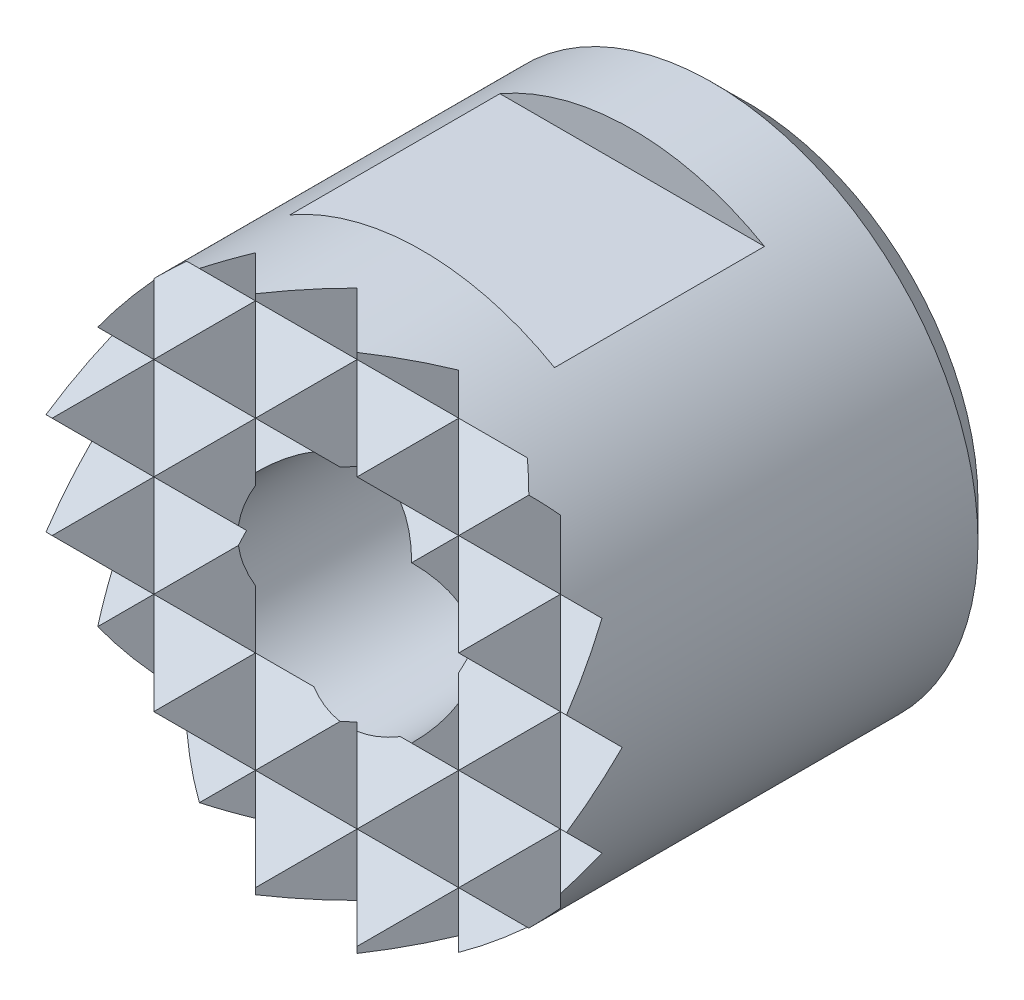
ISO-10303-21;
HEADER;
FILE_DESCRIPTION(('STEP AP214'),'2;1');
FILE_NAME('part.step','',(''),(''),'','','');
FILE_SCHEMA(('AUTOMOTIVE_DESIGN { 1 0 10303 214 1 1 1 1 }'));
ENDSEC;
DATA;
#1=APPLICATION_CONTEXT('core data for automotive mechanical design processes');
#2=APPLICATION_PROTOCOL_DEFINITION('international standard','automotive_design',2000,#1);
#3=PRODUCT_CONTEXT('',#1,'mechanical');
#4=PRODUCT('Part','Part','',(#3));
#5=PRODUCT_RELATED_PRODUCT_CATEGORY('part','',(#4));
#6=PRODUCT_DEFINITION_FORMATION('','',#4);
#7=PRODUCT_DEFINITION_CONTEXT('part definition',#1,'design');
#8=PRODUCT_DEFINITION('design','',#6,#7);
#9=PRODUCT_DEFINITION_SHAPE('','',#8);
#10=(LENGTH_UNIT() NAMED_UNIT(*) SI_UNIT(.MILLI.,.METRE.));
#11=(NAMED_UNIT(*) PLANE_ANGLE_UNIT() SI_UNIT($,.RADIAN.));
#12=(NAMED_UNIT(*) SI_UNIT($,.STERADIAN.) SOLID_ANGLE_UNIT());
#13=UNCERTAINTY_MEASURE_WITH_UNIT(LENGTH_MEASURE(1.E-05),#10,'distance_accuracy_value','');
#14=(GEOMETRIC_REPRESENTATION_CONTEXT(3) GLOBAL_UNCERTAINTY_ASSIGNED_CONTEXT((#13)) GLOBAL_UNIT_ASSIGNED_CONTEXT((#10,
#11,#12)) REPRESENTATION_CONTEXT('',''));
#15=CARTESIAN_POINT('',(0.,0.,0.));
#16=DIRECTION('',(0.,0.,1.));
#17=DIRECTION('',(1.,0.,0.));
#18=AXIS2_PLACEMENT_3D('',#15,#16,#17);
#19=CARTESIAN_POINT('',(-10.,-3.45,10.));
#20=DIRECTION('',(0.,0.70710678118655,-0.707106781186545));
#21=DIRECTION('',(0.,0.707106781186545,0.70710678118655));
#22=AXIS2_PLACEMENT_3D('',#19,#20,#21);
#23=PLANE('',#22);
#24=CARTESIAN_POINT('',(0.,0.,13.45));
#25=DIRECTION('',(0.,0.70710678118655,-0.707106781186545));
#26=DIRECTION('',(0.,-0.707106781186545,-0.70710678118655));
#27=AXIS2_PLACEMENT_3D('',#24,#25,#26);
#28=ELLIPSE('',#27,8.4852813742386,6.);
#29=CARTESIAN_POINT('',(4.24264068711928,-4.24264068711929,9.2073593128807));
#30=VERTEX_POINT('',#29);
#31=CARTESIAN_POINT('',(3.85227205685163,-4.6,8.85));
#32=VERTEX_POINT('',#31);
#33=EDGE_CURVE('E500',#30,#32,#28,.T.);
#34=ORIENTED_EDGE('',*,*,#33,.F.);
#35=DIRECTION('',(-0.577350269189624,0.577350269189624,0.577350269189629));
#36=VECTOR('',#35,1.);
#37=CARTESIAN_POINT('',(-1.03333333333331,1.0333333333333,14.4833333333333));
#38=LINE('',#37,#36);
#39=CARTESIAN_POINT('',(3.45,-3.45,10.));
#40=VERTEX_POINT('',#39);
#41=EDGE_CURVE('E795',#30,#40,#38,.T.);
#42=ORIENTED_EDGE('',*,*,#41,.T.);
#43=DIRECTION('',(-0.57735026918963,-0.577350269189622,-0.577350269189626));
#44=VECTOR('',#43,1.);
#45=CARTESIAN_POINT('',(-1.03333333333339,-7.93333333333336,5.51666666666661));
#46=LINE('',#45,#44);
#47=CARTESIAN_POINT('',(2.3,-4.6,8.85));
#48=VERTEX_POINT('',#47);
#49=EDGE_CURVE('E823',#40,#48,#46,.T.);
#50=ORIENTED_EDGE('',*,*,#49,.T.);
#51=DIRECTION('',(1.,0.,0.));
#52=VECTOR('',#51,1.);
#53=CARTESIAN_POINT('',(-10.,-4.6,8.85));
#54=LINE('',#53,#52);
#55=EDGE_CURVE('E408',#48,#32,#54,.T.);
#56=ORIENTED_EDGE('',*,*,#55,.T.);
#57=EDGE_LOOP('',(#34,#42,#50,#56));
#58=FACE_BOUND('',#57,.T.);
#59=ADVANCED_FACE('F15',(#58),#23,.F.);
#60=CARTESIAN_POINT('',(-10.,-4.6,8.85));
#61=DIRECTION('',(0.,-0.707106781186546,-0.707106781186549));
#62=DIRECTION('',(0.,0.707106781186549,-0.707106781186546));
#63=AXIS2_PLACEMENT_3D('',#60,#61,#62);
#64=PLANE('',#63);
#65=ORIENTED_EDGE('',*,*,#55,.F.);
#66=DIRECTION('',(0.577350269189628,-0.577350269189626,0.577350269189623));
#67=VECTOR('',#66,1.);
#68=CARTESIAN_POINT('',(-1.80000000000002,-0.499999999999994,4.75));
#69=LINE('',#68,#67);
#70=CARTESIAN_POINT('',(2.93380949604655,-5.23380949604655,9.48380949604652));
#71=VERTEX_POINT('',#70);
#72=EDGE_CURVE('E724',#48,#71,#69,.T.);
#73=ORIENTED_EDGE('',*,*,#72,.T.);
#74=CARTESIAN_POINT('',(0.,0.,4.25));
#75=DIRECTION('',(0.,-0.707106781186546,-0.707106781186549));
#76=DIRECTION('',(0.,0.707106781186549,-0.707106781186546));
#77=AXIS2_PLACEMENT_3D('',#74,#75,#76);
#78=ELLIPSE('',#77,8.48528137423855,6.);
#79=EDGE_CURVE('E503',#32,#71,#78,.T.);
#80=ORIENTED_EDGE('',*,*,#79,.F.);
#81=EDGE_LOOP('',(#65,#73,#80));
#82=FACE_BOUND('',#81,.T.);
#83=ADVANCED_FACE('F833',(#82),#64,.F.);
#84=CARTESIAN_POINT('',(-10.,5.75,10.));
#85=DIRECTION('',(0.,0.707106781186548,-0.707106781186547));
#86=DIRECTION('',(0.,0.707106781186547,0.707106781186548));
#87=AXIS2_PLACEMENT_3D('',#84,#85,#86);
#88=PLANE('',#87);
#89=CARTESIAN_POINT('',(0.,0.,4.25));
#90=DIRECTION('',(0.,0.707106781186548,-0.707106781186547));
#91=DIRECTION('',(0.,-0.707106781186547,-0.707106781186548));
#92=AXIS2_PLACEMENT_3D('',#89,#90,#91);
#93=ELLIPSE('',#92,8.48528137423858,6.);
#94=CARTESIAN_POINT('',(2.93380949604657,5.23380949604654,9.48380949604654));
#95=VERTEX_POINT('',#94);
#96=CARTESIAN_POINT('',(3.85227205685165,4.6,8.85));
#97=VERTEX_POINT('',#96);
#98=EDGE_CURVE('E497',#95,#97,#93,.T.);
#99=ORIENTED_EDGE('',*,*,#98,.F.);
#100=DIRECTION('',(-0.577350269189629,-0.577350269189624,-0.577350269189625));
#101=VECTOR('',#100,1.);
#102=CARTESIAN_POINT('',(-1.03333333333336,1.26666666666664,5.51666666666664));
#103=LINE('',#102,#101);
#104=CARTESIAN_POINT('',(2.30000000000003,4.6,8.85));
#105=VERTEX_POINT('',#104);
#106=EDGE_CURVE('E809',#95,#105,#103,.T.);
#107=ORIENTED_EDGE('',*,*,#106,.T.);
#108=DIRECTION('',(1.,0.,0.));
#109=VECTOR('',#108,1.);
#110=CARTESIAN_POINT('',(-10.,4.6,8.85));
#111=LINE('',#110,#109);
#112=EDGE_CURVE('E413',#105,#97,#111,.T.);
#113=ORIENTED_EDGE('',*,*,#112,.T.);
#114=EDGE_LOOP('',(#99,#107,#113));
#115=FACE_BOUND('',#114,.T.);
#116=ADVANCED_FACE('F1006',(#115),#88,.F.);
#117=CARTESIAN_POINT('',(-10.,4.6,8.85));
#118=DIRECTION('',(0.,-0.707106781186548,-0.707106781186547));
#119=DIRECTION('',(0.,0.707106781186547,-0.707106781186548));
#120=AXIS2_PLACEMENT_3D('',#117,#118,#119);
#121=PLANE('',#120);
#122=DIRECTION('',(0.577350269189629,-0.577350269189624,0.577350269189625));
#123=VECTOR('',#122,1.);
#124=CARTESIAN_POINT('',(-1.80000000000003,8.7,4.75));
#125=LINE('',#124,#123);
#126=CARTESIAN_POINT('',(3.45,3.45,10.));
#127=VERTEX_POINT('',#126);
#128=EDGE_CURVE('E807',#105,#127,#125,.T.);
#129=ORIENTED_EDGE('',*,*,#128,.T.);
#130=DIRECTION('',(0.577350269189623,0.577350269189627,-0.577350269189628));
#131=VECTOR('',#130,1.);
#132=CARTESIAN_POINT('',(-0.266666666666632,-0.26666666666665,13.7166666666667));
#133=LINE('',#132,#131);
#134=CARTESIAN_POINT('',(4.24264068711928,4.24264068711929,9.20735931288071));
#135=VERTEX_POINT('',#134);
#136=EDGE_CURVE('E926',#127,#135,#133,.T.);
#137=ORIENTED_EDGE('',*,*,#136,.T.);
#138=CARTESIAN_POINT('',(0.,0.,13.45));
#139=DIRECTION('',(0.,-0.707106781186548,-0.707106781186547));
#140=DIRECTION('',(0.,0.707106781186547,-0.707106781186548));
#141=AXIS2_PLACEMENT_3D('',#138,#139,#140);
#142=ELLIPSE('',#141,8.48528137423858,6.);
#143=EDGE_CURVE('E494',#97,#135,#142,.T.);
#144=ORIENTED_EDGE('',*,*,#143,.F.);
#145=ORIENTED_EDGE('',*,*,#112,.F.);
#146=EDGE_LOOP('',(#129,#137,#144,#145));
#147=FACE_BOUND('',#146,.T.);
#148=ADVANCED_FACE('F1267',(#147),#121,.F.);
#149=CARTESIAN_POINT('',(-10.,2.3,8.85));
#150=DIRECTION('',(0.,-0.707106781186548,-0.707106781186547));
#151=DIRECTION('',(0.,0.707106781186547,-0.707106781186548));
#152=AXIS2_PLACEMENT_3D('',#149,#150,#151);
#153=PLANE('',#152);
#154=CARTESIAN_POINT('',(0.,0.,11.15));
#155=DIRECTION('',(0.,-0.707106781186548,-0.707106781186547));
#156=DIRECTION('',(0.,-0.707106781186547,0.707106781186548));
#157=AXIS2_PLACEMENT_3D('',#154,#155,#156);
#158=ELLIPSE('',#157,3.53553390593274,2.5);
#159=CARTESIAN_POINT('',(0.979795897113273,2.3,8.85));
#160=VERTEX_POINT('',#159);
#161=CARTESIAN_POINT('',(1.76776695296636,1.76776695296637,9.38223304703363));
#162=VERTEX_POINT('',#161);
#163=EDGE_CURVE('E475',#160,#162,#158,.T.);
#164=ORIENTED_EDGE('',*,*,#163,.T.);
#165=DIRECTION('',(0.577350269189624,0.577350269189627,-0.577350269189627));
#166=VECTOR('',#165,1.);
#167=CARTESIAN_POINT('',(-1.79999999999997,-1.8,12.95));
#168=LINE('',#167,#166);
#169=CARTESIAN_POINT('',(2.3,2.3,8.85));
#170=VERTEX_POINT('',#169);
#171=EDGE_CURVE('E716',#162,#170,#168,.T.);
#172=ORIENTED_EDGE('',*,*,#171,.T.);
#173=DIRECTION('',(1.,0.,0.));
#174=VECTOR('',#173,1.);
#175=CARTESIAN_POINT('',(-10.,2.3,8.85));
#176=LINE('',#175,#174);
#177=EDGE_CURVE('E414',#160,#170,#176,.T.);
#178=ORIENTED_EDGE('',*,*,#177,.F.);
#179=EDGE_LOOP('',(#164,#172,#178));
#180=FACE_BOUND('',#179,.T.);
#181=ADVANCED_FACE('F715',(#180),#153,.F.);
#182=DIRECTION('',(1.,0.,0.));
#183=VECTOR('',#182,1.);
#184=CARTESIAN_POINT('',(-10.,1.15,10.));
#185=LINE('',#184,#183);
#186=CARTESIAN_POINT('',(-5.88876048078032,1.15,10.));
#187=VERTEX_POINT('',#186);
#188=CARTESIAN_POINT('',(-5.75,1.15000000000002,10.));
#189=VERTEX_POINT('',#188);
#190=EDGE_CURVE('E387',#187,#189,#185,.T.);
#191=ORIENTED_EDGE('',*,*,#190,.T.);
#192=DIRECTION('',(0.577350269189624,0.577350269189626,-0.577350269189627));
#193=VECTOR('',#192,1.);
#194=CARTESIAN_POINT('',(-6.4,0.5,10.65));
#195=LINE('',#194,#193);
#196=CARTESIAN_POINT('',(-4.6,2.3,8.85));
#197=VERTEX_POINT('',#196);
#198=EDGE_CURVE('E1862',#189,#197,#195,.T.);
#199=ORIENTED_EDGE('',*,*,#198,.T.);
#200=CARTESIAN_POINT('',(-5.54166040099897,2.3,8.85));
#201=VERTEX_POINT('',#200);
#202=EDGE_CURVE('E419',#201,#197,#176,.T.);
#203=ORIENTED_EDGE('',*,*,#202,.F.);
#204=CARTESIAN_POINT('',(0.,0.,11.15));
#205=DIRECTION('',(0.,-0.707106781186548,-0.707106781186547));
#206=DIRECTION('',(0.,0.707106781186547,-0.707106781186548));
#207=AXIS2_PLACEMENT_3D('',#204,#205,#206);
#208=ELLIPSE('',#207,8.48528137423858,6.);
#209=EDGE_CURVE('E438',#187,#201,#208,.T.);
#210=ORIENTED_EDGE('',*,*,#209,.F.);
#211=EDGE_LOOP('',(#191,#199,#203,#210));
#212=FACE_BOUND('',#211,.T.);
#213=ADVANCED_FACE('F1159',(#212),#153,.F.);
#214=CARTESIAN_POINT('',(-2.3,2.3,8.85));
#215=VERTEX_POINT('',#214);
#216=CARTESIAN_POINT('',(-0.979795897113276,2.3,8.85));
#217=VERTEX_POINT('',#216);
#218=EDGE_CURVE('E417',#215,#217,#176,.T.);
#219=ORIENTED_EDGE('',*,*,#218,.F.);
#220=DIRECTION('',(0.577350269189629,-0.577350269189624,0.577350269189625));
#221=VECTOR('',#220,1.);
#222=CARTESIAN_POINT('',(-4.8666666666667,4.86666666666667,6.28333333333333));
#223=LINE('',#222,#221);
#224=CARTESIAN_POINT('',(-1.76776695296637,1.76776695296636,9.38223304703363));
#225=VERTEX_POINT('',#224);
#226=EDGE_CURVE('E591',#215,#225,#223,.T.);
#227=ORIENTED_EDGE('',*,*,#226,.T.);
#228=EDGE_CURVE('E478',#225,#217,#158,.T.);
#229=ORIENTED_EDGE('',*,*,#228,.T.);
#230=EDGE_LOOP('',(#219,#227,#229));
#231=FACE_BOUND('',#230,.T.);
#232=ADVANCED_FACE('F1473',(#231),#153,.F.);
#233=CARTESIAN_POINT('',(-10.,1.15,10.));
#234=DIRECTION('',(0.,0.707106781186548,-0.707106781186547));
#235=DIRECTION('',(0.,0.707106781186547,0.707106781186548));
#236=AXIS2_PLACEMENT_3D('',#233,#234,#235);
#237=PLANE('',#236);
#238=DIRECTION('',(1.,0.,0.));
#239=VECTOR('',#238,1.);
#240=CARTESIAN_POINT('',(-10.,0.,8.85));
#241=LINE('',#240,#239);
#242=CARTESIAN_POINT('',(-6.,0.,8.85));
#243=VERTEX_POINT('',#242);
#244=CARTESIAN_POINT('',(-4.6,0.,8.85));
#245=VERTEX_POINT('',#244);
#246=EDGE_CURVE('E388',#243,#245,#241,.T.);
#247=ORIENTED_EDGE('',*,*,#246,.T.);
#248=DIRECTION('',(-0.577350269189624,0.577350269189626,0.577350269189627));
#249=VECTOR('',#248,1.);
#250=CARTESIAN_POINT('',(-7.16666666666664,2.56666666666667,11.4166666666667));
#251=LINE('',#250,#249);
#252=EDGE_CURVE('E1860',#245,#189,#251,.T.);
#253=ORIENTED_EDGE('',*,*,#252,.T.);
#254=ORIENTED_EDGE('',*,*,#190,.F.);
#255=CARTESIAN_POINT('',(0.,0.,8.85));
#256=DIRECTION('',(0.,0.707106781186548,-0.707106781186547));
#257=DIRECTION('',(0.,-0.707106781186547,-0.707106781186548));
#258=AXIS2_PLACEMENT_3D('',#255,#256,#257);
#259=ELLIPSE('',#258,8.48528137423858,6.);
#260=EDGE_CURVE('E437',#243,#187,#259,.T.);
#261=ORIENTED_EDGE('',*,*,#260,.F.);
#262=EDGE_LOOP('',(#247,#253,#254,#261));
#263=FACE_BOUND('',#262,.T.);
#264=ADVANCED_FACE('F1249',(#263),#237,.F.);
#265=DIRECTION('',(-0.577350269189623,0.577350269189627,0.577350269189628));
#266=VECTOR('',#265,1.);
#267=CARTESIAN_POINT('',(-1.0333333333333,5.63333333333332,14.4833333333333));
#268=LINE('',#267,#266);
#269=CARTESIAN_POINT('',(4.6,0.,8.85));
#270=VERTEX_POINT('',#269);
#271=CARTESIAN_POINT('',(3.45,1.14999999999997,10.));
#272=VERTEX_POINT('',#271);
#273=EDGE_CURVE('E938',#270,#272,#268,.T.);
#274=ORIENTED_EDGE('',*,*,#273,.T.);
#275=DIRECTION('',(-0.577350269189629,-0.577350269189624,-0.577350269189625));
#276=VECTOR('',#275,1.);
#277=CARTESIAN_POINT('',(-1.03333333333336,-3.33333333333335,5.51666666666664));
#278=LINE('',#277,#276);
#279=CARTESIAN_POINT('',(2.49257215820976,0.192572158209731,9.04257215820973));
#280=VERTEX_POINT('',#279);
#281=EDGE_CURVE('E813',#272,#280,#278,.T.);
#282=ORIENTED_EDGE('',*,*,#281,.T.);
#283=CARTESIAN_POINT('',(0.,0.,8.85));
#284=DIRECTION('',(0.,0.707106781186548,-0.707106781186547));
#285=DIRECTION('',(0.,0.707106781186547,0.707106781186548));
#286=AXIS2_PLACEMENT_3D('',#283,#284,#285);
#287=ELLIPSE('',#286,3.53553390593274,2.5);
#288=CARTESIAN_POINT('',(2.5,0.,8.85));
#289=VERTEX_POINT('',#288);
#290=EDGE_CURVE('E482',#280,#289,#287,.T.);
#291=ORIENTED_EDGE('',*,*,#290,.T.);
#292=EDGE_CURVE('E389',#289,#270,#241,.T.);
#293=ORIENTED_EDGE('',*,*,#292,.T.);
#294=EDGE_LOOP('',(#274,#282,#291,#293));
#295=FACE_BOUND('',#294,.T.);
#296=ADVANCED_FACE('F964',(#295),#237,.F.);
#297=CARTESIAN_POINT('',(-10.,0.,8.85));
#298=DIRECTION('',(0.,-0.707106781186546,-0.707106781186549));
#299=DIRECTION('',(0.,0.707106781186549,-0.707106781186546));
#300=AXIS2_PLACEMENT_3D('',#297,#298,#299);
#301=PLANE('',#300);
#302=CARTESIAN_POINT('',(0.,0.,8.85));
#303=DIRECTION('',(0.,-0.707106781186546,-0.707106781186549));
#304=DIRECTION('',(0.,-0.707106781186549,0.707106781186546));
#305=AXIS2_PLACEMENT_3D('',#302,#303,#304);
#306=ELLIPSE('',#305,3.53553390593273,2.5);
#307=CARTESIAN_POINT('',(2.49257215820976,-0.192572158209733,9.04257215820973));
#308=VERTEX_POINT('',#307);
#309=EDGE_CURVE('E483',#289,#308,#306,.T.);
#310=ORIENTED_EDGE('',*,*,#309,.T.);
#311=DIRECTION('',(0.577350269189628,-0.577350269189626,0.577350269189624));
#312=VECTOR('',#311,1.);
#313=CARTESIAN_POINT('',(-1.8,4.1,4.75));
#314=LINE('',#313,#312);
#315=CARTESIAN_POINT('',(3.45,-1.15000000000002,10.));
#316=VERTEX_POINT('',#315);
#317=EDGE_CURVE('E821',#308,#316,#314,.T.);
#318=ORIENTED_EDGE('',*,*,#317,.T.);
#319=DIRECTION('',(0.577350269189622,0.577350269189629,-0.577350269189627));
#320=VECTOR('',#319,1.);
#321=CARTESIAN_POINT('',(-0.266666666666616,-4.86666666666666,13.7166666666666));
#322=LINE('',#321,#320);
#323=EDGE_CURVE('E800',#316,#270,#322,.T.);
#324=ORIENTED_EDGE('',*,*,#323,.T.);
#325=ORIENTED_EDGE('',*,*,#292,.F.);
#326=EDGE_LOOP('',(#310,#318,#324,#325));
#327=FACE_BOUND('',#326,.T.);
#328=ADVANCED_FACE('F944',(#327),#301,.F.);
#329=DIRECTION('',(1.,0.,0.));
#330=VECTOR('',#329,1.);
#331=CARTESIAN_POINT('',(-10.,-1.15,10.));
#332=LINE('',#331,#330);
#333=CARTESIAN_POINT('',(-5.88876048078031,-1.15,10.));
#334=VERTEX_POINT('',#333);
#335=CARTESIAN_POINT('',(-5.75,-1.14999999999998,10.));
#336=VERTEX_POINT('',#335);
#337=EDGE_CURVE('E396',#334,#336,#332,.T.);
#338=ORIENTED_EDGE('',*,*,#337,.T.);
#339=DIRECTION('',(0.577350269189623,0.577350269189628,-0.577350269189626));
#340=VECTOR('',#339,1.);
#341=CARTESIAN_POINT('',(-6.4,-1.8,10.65));
#342=LINE('',#341,#340);
#343=EDGE_CURVE('E1866',#336,#245,#342,.T.);
#344=ORIENTED_EDGE('',*,*,#343,.T.);
#345=ORIENTED_EDGE('',*,*,#246,.F.);
#346=CARTESIAN_POINT('',(0.,0.,8.85));
#347=DIRECTION('',(0.,-0.707106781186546,-0.707106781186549));
#348=DIRECTION('',(0.,0.707106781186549,-0.707106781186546));
#349=AXIS2_PLACEMENT_3D('',#346,#347,#348);
#350=ELLIPSE('',#349,8.48528137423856,6.);
#351=EDGE_CURVE('E430',#334,#243,#350,.T.);
#352=ORIENTED_EDGE('',*,*,#351,.F.);
#353=EDGE_LOOP('',(#338,#344,#345,#352));
#354=FACE_BOUND('',#353,.T.);
#355=ADVANCED_FACE('F1225',(#354),#301,.F.);
#356=CARTESIAN_POINT('',(-10.,-1.15,10.));
#357=DIRECTION('',(0.,0.70710678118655,-0.707106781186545));
#358=DIRECTION('',(0.,0.707106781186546,0.70710678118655));
#359=AXIS2_PLACEMENT_3D('',#356,#357,#358);
#360=PLANE('',#359);
#361=DIRECTION('',(1.,0.,0.));
#362=VECTOR('',#361,1.);
#363=CARTESIAN_POINT('',(-10.,-2.3,8.85));
#364=LINE('',#363,#362);
#365=CARTESIAN_POINT('',(-5.54166040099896,-2.3,8.85));
#366=VERTEX_POINT('',#365);
#367=CARTESIAN_POINT('',(-4.6,-2.30000000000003,8.85));
#368=VERTEX_POINT('',#367);
#369=EDGE_CURVE('E397',#366,#368,#364,.T.);
#370=ORIENTED_EDGE('',*,*,#369,.T.);
#371=DIRECTION('',(-0.577350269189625,0.577350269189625,0.577350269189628));
#372=VECTOR('',#371,1.);
#373=CARTESIAN_POINT('',(-7.16666666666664,0.266666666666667,11.4166666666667));
#374=LINE('',#373,#372);
#375=EDGE_CURVE('E1878',#368,#336,#374,.T.);
#376=ORIENTED_EDGE('',*,*,#375,.T.);
#377=ORIENTED_EDGE('',*,*,#337,.F.);
#378=CARTESIAN_POINT('',(0.,0.,11.15));
#379=DIRECTION('',(0.,0.70710678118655,-0.707106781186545));
#380=DIRECTION('',(0.,-0.707106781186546,-0.70710678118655));
#381=AXIS2_PLACEMENT_3D('',#378,#379,#380);
#382=ELLIPSE('',#381,8.4852813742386,6.);
#383=EDGE_CURVE('E429',#366,#334,#382,.T.);
#384=ORIENTED_EDGE('',*,*,#383,.F.);
#385=EDGE_LOOP('',(#370,#376,#377,#384));
#386=FACE_BOUND('',#385,.T.);
#387=ADVANCED_FACE('F1435',(#386),#360,.F.);
#388=CARTESIAN_POINT('',(0.,0.,11.15));
#389=DIRECTION('',(0.,0.70710678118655,-0.707106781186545));
#390=DIRECTION('',(0.,0.707106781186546,0.70710678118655));
#391=AXIS2_PLACEMENT_3D('',#388,#389,#390);
#392=ELLIPSE('',#391,3.53553390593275,2.5);
#393=CARTESIAN_POINT('',(-0.979795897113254,-2.3,8.85));
#394=VERTEX_POINT('',#393);
#395=CARTESIAN_POINT('',(-1.76776695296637,-1.76776695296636,9.38223304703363));
#396=VERTEX_POINT('',#395);
#397=EDGE_CURVE('E487',#394,#396,#392,.T.);
#398=ORIENTED_EDGE('',*,*,#397,.T.);
#399=DIRECTION('',(-0.577350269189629,-0.577350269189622,-0.577350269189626));
#400=VECTOR('',#399,1.);
#401=CARTESIAN_POINT('',(-4.1,-4.1,7.05));
#402=LINE('',#401,#400);
#403=CARTESIAN_POINT('',(-2.3,-2.3,8.85));
#404=VERTEX_POINT('',#403);
#405=EDGE_CURVE('E605',#396,#404,#402,.T.);
#406=ORIENTED_EDGE('',*,*,#405,.T.);
#407=EDGE_CURVE('E401',#404,#394,#364,.T.);
#408=ORIENTED_EDGE('',*,*,#407,.T.);
#409=EDGE_LOOP('',(#398,#406,#408));
#410=FACE_BOUND('',#409,.T.);
#411=ADVANCED_FACE('F766',(#410),#360,.F.);
#412=CARTESIAN_POINT('',(0.97979589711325,-2.3,8.85));
#413=VERTEX_POINT('',#412);
#414=CARTESIAN_POINT('',(2.3,-2.3,8.85));
#415=VERTEX_POINT('',#414);
#416=EDGE_CURVE('E398',#413,#415,#364,.T.);
#417=ORIENTED_EDGE('',*,*,#416,.T.);
#418=DIRECTION('',(-0.577350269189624,0.577350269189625,0.577350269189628));
#419=VECTOR('',#418,1.);
#420=CARTESIAN_POINT('',(-2.56666666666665,2.56666666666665,13.7166666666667));
#421=LINE('',#420,#419);
#422=CARTESIAN_POINT('',(1.76776695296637,-1.76776695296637,9.38223304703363));
#423=VERTEX_POINT('',#422);
#424=EDGE_CURVE('E738',#415,#423,#421,.T.);
#425=ORIENTED_EDGE('',*,*,#424,.T.);
#426=EDGE_CURVE('E490',#423,#413,#392,.T.);
#427=ORIENTED_EDGE('',*,*,#426,.T.);
#428=EDGE_LOOP('',(#417,#425,#427));
#429=FACE_BOUND('',#428,.T.);
#430=ADVANCED_FACE('F755',(#429),#360,.F.);
#431=CARTESIAN_POINT('',(-10.,-2.3,8.85));
#432=DIRECTION('',(0.,-0.707106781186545,-0.70710678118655));
#433=DIRECTION('',(0.,0.70710678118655,-0.707106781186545));
#434=AXIS2_PLACEMENT_3D('',#431,#432,#433);
#435=PLANE('',#434);
#436=CARTESIAN_POINT('',(0.,0.,6.55));
#437=DIRECTION('',(0.,-0.707106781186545,-0.70710678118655));
#438=DIRECTION('',(0.,-0.70710678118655,0.707106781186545));
#439=AXIS2_PLACEMENT_3D('',#436,#437,#438);
#440=ELLIPSE('',#439,3.53553390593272,2.5);
#441=CARTESIAN_POINT('',(0.192572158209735,-2.49257215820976,9.04257215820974));
#442=VERTEX_POINT('',#441);
#443=EDGE_CURVE('E491',#413,#442,#440,.T.);
#444=ORIENTED_EDGE('',*,*,#443,.T.);
#445=DIRECTION('',(0.577350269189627,-0.577350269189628,0.577350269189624));
#446=VECTOR('',#445,1.);
#447=CARTESIAN_POINT('',(-3.33333333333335,1.03333333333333,5.51666666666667));
#448=LINE('',#447,#446);
#449=CARTESIAN_POINT('',(1.15,-3.45,10.));
#450=VERTEX_POINT('',#449);
#451=EDGE_CURVE('E560',#442,#450,#448,.T.);
#452=ORIENTED_EDGE('',*,*,#451,.T.);
#453=DIRECTION('',(0.577350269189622,0.57735026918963,-0.577350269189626));
#454=VECTOR('',#453,1.);
#455=CARTESIAN_POINT('',(-1.79999999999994,-6.4,12.95));
#456=LINE('',#455,#454);
#457=EDGE_CURVE('E734',#450,#415,#456,.T.);
#458=ORIENTED_EDGE('',*,*,#457,.T.);
#459=ORIENTED_EDGE('',*,*,#416,.F.);
#460=EDGE_LOOP('',(#444,#452,#458,#459));
#461=FACE_BOUND('',#460,.T.);
#462=ADVANCED_FACE('F1412',(#461),#435,.F.);
#463=CARTESIAN_POINT('',(4.6,-2.3,8.85));
#464=VERTEX_POINT('',#463);
#465=CARTESIAN_POINT('',(5.54166040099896,-2.3,8.85));
#466=VERTEX_POINT('',#465);
#467=EDGE_CURVE('E406',#464,#466,#364,.T.);
#468=ORIENTED_EDGE('',*,*,#467,.F.);
#469=DIRECTION('',(0.577350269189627,-0.577350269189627,0.577350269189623));
#470=VECTOR('',#469,1.);
#471=CARTESIAN_POINT('',(-0.26666666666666,2.56666666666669,3.98333333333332));
#472=LINE('',#471,#470);
#473=CARTESIAN_POINT('',(5.23380949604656,-2.93380949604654,9.48380949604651));
#474=VERTEX_POINT('',#473);
#475=EDGE_CURVE('E924',#464,#474,#472,.T.);
#476=ORIENTED_EDGE('',*,*,#475,.T.);
#477=CARTESIAN_POINT('',(0.,0.,6.55));
#478=DIRECTION('',(0.,-0.707106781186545,-0.70710678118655));
#479=DIRECTION('',(0.,0.70710678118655,-0.707106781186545));
#480=AXIS2_PLACEMENT_3D('',#477,#478,#479);
#481=ELLIPSE('',#480,8.48528137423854,6.);
#482=EDGE_CURVE('E425',#466,#474,#481,.T.);
#483=ORIENTED_EDGE('',*,*,#482,.F.);
#484=EDGE_LOOP('',(#468,#476,#483));
#485=FACE_BOUND('',#484,.T.);
#486=ADVANCED_FACE('F1403',(#485),#435,.F.);
#487=CARTESIAN_POINT('',(-5.23380949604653,-2.93380949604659,9.48380949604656));
#488=VERTEX_POINT('',#487);
#489=EDGE_CURVE('E423',#488,#366,#481,.T.);
#490=ORIENTED_EDGE('',*,*,#489,.F.);
#491=DIRECTION('',(0.577350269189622,0.57735026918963,-0.577350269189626));
#492=VECTOR('',#491,1.);
#493=CARTESIAN_POINT('',(-6.4,-4.1,10.65));
#494=LINE('',#493,#492);
#495=EDGE_CURVE('E1900',#488,#368,#494,.T.);
#496=ORIENTED_EDGE('',*,*,#495,.T.);
#497=ORIENTED_EDGE('',*,*,#369,.F.);
#498=EDGE_LOOP('',(#490,#496,#497));
#499=FACE_BOUND('',#498,.T.);
#500=ADVANCED_FACE('F1394',(#499),#435,.F.);
#501=DIRECTION('',(0.577350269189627,-0.577350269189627,0.577350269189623));
#502=VECTOR('',#501,1.);
#503=CARTESIAN_POINT('',(-4.86666666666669,0.266666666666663,6.28333333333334));
#504=LINE('',#503,#502);
#505=CARTESIAN_POINT('',(-1.15,-3.45,10.));
#506=VERTEX_POINT('',#505);
#507=EDGE_CURVE('E602',#404,#506,#504,.T.);
#508=ORIENTED_EDGE('',*,*,#507,.T.);
#509=DIRECTION('',(0.577350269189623,0.577350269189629,-0.577350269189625));
#510=VECTOR('',#509,1.);
#511=CARTESIAN_POINT('',(-3.33333333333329,-5.63333333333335,12.1833333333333));
#512=LINE('',#511,#510);
#513=CARTESIAN_POINT('',(-0.192572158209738,-2.49257215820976,9.04257215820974));
#514=VERTEX_POINT('',#513);
#515=EDGE_CURVE('E579',#506,#514,#512,.T.);
#516=ORIENTED_EDGE('',*,*,#515,.T.);
#517=EDGE_CURVE('E495',#514,#394,#440,.T.);
#518=ORIENTED_EDGE('',*,*,#517,.T.);
#519=ORIENTED_EDGE('',*,*,#407,.F.);
#520=EDGE_LOOP('',(#508,#516,#518,#519));
#521=FACE_BOUND('',#520,.T.);
#522=ADVANCED_FACE('F763',(#521),#435,.F.);
#523=CARTESIAN_POINT('',(-10.,3.45,10.));
#524=DIRECTION('',(0.,0.707106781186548,-0.707106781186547));
#525=DIRECTION('',(0.,0.707106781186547,0.707106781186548));
#526=AXIS2_PLACEMENT_3D('',#523,#524,#525);
#527=PLANE('',#526);
#528=DIRECTION('',(-0.577350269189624,0.577350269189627,0.577350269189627));
#529=VECTOR('',#528,1.);
#530=CARTESIAN_POINT('',(-2.56666666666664,7.16666666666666,13.7166666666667));
#531=LINE('',#530,#529);
#532=CARTESIAN_POINT('',(1.15,3.45,10.));
#533=VERTEX_POINT('',#532);
#534=EDGE_CURVE('E23',#170,#533,#531,.T.);
#535=ORIENTED_EDGE('',*,*,#534,.T.);
#536=DIRECTION('',(-0.577350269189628,-0.577350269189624,-0.577350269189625));
#537=VECTOR('',#536,1.);
#538=CARTESIAN_POINT('',(-2.56666666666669,-0.266666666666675,6.28333333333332));
#539=LINE('',#538,#537);
#540=CARTESIAN_POINT('',(0.192572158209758,2.49257215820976,9.04257215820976));
#541=VERTEX_POINT('',#540);
#542=EDGE_CURVE('E9',#533,#541,#539,.T.);
#543=ORIENTED_EDGE('',*,*,#542,.T.);
#544=CARTESIAN_POINT('',(0.,0.,6.55));
#545=DIRECTION('',(0.,0.707106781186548,-0.707106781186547));
#546=DIRECTION('',(0.,0.707106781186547,0.707106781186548));
#547=AXIS2_PLACEMENT_3D('',#544,#545,#546);
#548=ELLIPSE('',#547,3.53553390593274,2.5);
#549=EDGE_CURVE('E471',#541,#160,#548,.T.);
#550=ORIENTED_EDGE('',*,*,#549,.T.);
#551=ORIENTED_EDGE('',*,*,#177,.T.);
#552=EDGE_LOOP('',(#535,#543,#550,#551));
#553=FACE_BOUND('',#552,.T.);
#554=ADVANCED_FACE('F534',(#553),#527,.F.);
#555=CARTESIAN_POINT('',(0.,0.,6.55));
#556=DIRECTION('',(0.,0.707106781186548,-0.707106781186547));
#557=DIRECTION('',(0.,-0.707106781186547,-0.707106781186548));
#558=AXIS2_PLACEMENT_3D('',#555,#556,#557);
#559=ELLIPSE('',#558,8.48528137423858,6.);
#560=CARTESIAN_POINT('',(5.23380949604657,2.93380949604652,9.48380949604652));
#561=VERTEX_POINT('',#560);
#562=CARTESIAN_POINT('',(5.54166040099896,2.3,8.85));
#563=VERTEX_POINT('',#562);
#564=EDGE_CURVE('E420',#561,#563,#559,.T.);
#565=ORIENTED_EDGE('',*,*,#564,.F.);
#566=DIRECTION('',(-0.577350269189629,-0.577350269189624,-0.577350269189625));
#567=VECTOR('',#566,1.);
#568=CARTESIAN_POINT('',(0.499999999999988,-1.80000000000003,4.75));
#569=LINE('',#568,#567);
#570=CARTESIAN_POINT('',(4.6,2.29999999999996,8.85));
#571=VERTEX_POINT('',#570);
#572=EDGE_CURVE('E523',#561,#571,#569,.T.);
#573=ORIENTED_EDGE('',*,*,#572,.T.);
#574=EDGE_CURVE('E380',#571,#563,#176,.T.);
#575=ORIENTED_EDGE('',*,*,#574,.T.);
#576=EDGE_LOOP('',(#565,#573,#575));
#577=FACE_BOUND('',#576,.T.);
#578=ADVANCED_FACE('F901',(#577),#527,.F.);
#579=ORIENTED_EDGE('',*,*,#202,.T.);
#580=DIRECTION('',(-0.577350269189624,0.577350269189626,0.577350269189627));
#581=VECTOR('',#580,1.);
#582=CARTESIAN_POINT('',(-7.16666666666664,4.86666666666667,11.4166666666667));
#583=LINE('',#582,#581);
#584=CARTESIAN_POINT('',(-5.23380949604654,2.93380949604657,9.48380949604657));
#585=VERTEX_POINT('',#584);
#586=EDGE_CURVE('E514',#197,#585,#583,.T.);
#587=ORIENTED_EDGE('',*,*,#586,.T.);
#588=EDGE_CURVE('E422',#201,#585,#559,.T.);
#589=ORIENTED_EDGE('',*,*,#588,.F.);
#590=EDGE_LOOP('',(#579,#587,#589));
#591=FACE_BOUND('',#590,.T.);
#592=ADVANCED_FACE('F1365',(#591),#527,.F.);
#593=CARTESIAN_POINT('',(-0.19257215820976,2.49257215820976,9.04257215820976));
#594=VERTEX_POINT('',#593);
#595=EDGE_CURVE('E472',#217,#594,#548,.T.);
#596=ORIENTED_EDGE('',*,*,#595,.T.);
#597=DIRECTION('',(-0.577350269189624,0.577350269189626,0.577350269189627));
#598=VECTOR('',#597,1.);
#599=CARTESIAN_POINT('',(-4.1,6.4,12.95));
#600=LINE('',#599,#598);
#601=CARTESIAN_POINT('',(-1.15,3.45,10.));
#602=VERTEX_POINT('',#601);
#603=EDGE_CURVE('E520',#594,#602,#600,.T.);
#604=ORIENTED_EDGE('',*,*,#603,.T.);
#605=DIRECTION('',(-0.577350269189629,-0.577350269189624,-0.577350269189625));
#606=VECTOR('',#605,1.);
#607=CARTESIAN_POINT('',(-4.1,0.499999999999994,7.05));
#608=LINE('',#607,#606);
#609=EDGE_CURVE('E517',#602,#215,#608,.T.);
#610=ORIENTED_EDGE('',*,*,#609,.T.);
#611=ORIENTED_EDGE('',*,*,#218,.T.);
#612=EDGE_LOOP('',(#596,#604,#610,#611));
#613=FACE_BOUND('',#612,.T.);
#614=ADVANCED_FACE('F1032',(#613),#527,.F.);
#615=CARTESIAN_POINT('',(0.,0.,0.));
#616=DIRECTION('',(0.,0.,1.));
#617=DIRECTION('',(1.,0.,0.));
#618=AXIS2_PLACEMENT_3D('',#615,#616,#617);
#619=PLANE('',#618);
#620=CARTESIAN_POINT('',(0.,0.,0.));
#621=DIRECTION('',(0.,0.,1.));
#622=DIRECTION('',(1.,0.,0.));
#623=AXIS2_PLACEMENT_3D('',#620,#621,#622);
#624=CIRCLE('',#623,5.2);
#625=CARTESIAN_POINT('',(5.2,0.,0.));
#626=VERTEX_POINT('',#625);
#627=EDGE_CURVE('E456',#626,#626,#624,.F.);
#628=ORIENTED_EDGE('',*,*,#627,.T.);
#629=EDGE_LOOP('',(#628));
#630=FACE_BOUND('',#629,.T.);
#631=CARTESIAN_POINT('',(0.,0.,0.));
#632=DIRECTION('',(0.,0.,1.));
#633=DIRECTION('',(1.,0.,0.));
#634=AXIS2_PLACEMENT_3D('',#631,#632,#633);
#635=CIRCLE('',#634,2.95);
#636=CARTESIAN_POINT('',(2.95,0.,0.));
#637=VERTEX_POINT('',#636);
#638=EDGE_CURVE('E450',#637,#637,#635,.T.);
#639=ORIENTED_EDGE('',*,*,#638,.T.);
#640=EDGE_LOOP('',(#639));
#641=FACE_BOUND('',#640,.T.);
#642=ADVANCED_FACE('F1346',(#630,#641),#619,.F.);
#643=CARTESIAN_POINT('',(0.,0.,10.));
#644=DIRECTION('',(0.,0.,-1.));
#645=DIRECTION('',(-1.,0.,0.));
#646=AXIS2_PLACEMENT_3D('',#643,#644,#645);
#647=CYLINDRICAL_SURFACE('',#646,6.);
#648=CARTESIAN_POINT('',(0.,0.,7.375));
#649=DIRECTION('',(0.,0.,1.));
#650=DIRECTION('',(0.,-1.,0.));
#651=AXIS2_PLACEMENT_3D('',#648,#649,#650);
#652=CIRCLE('',#651,6.);
#653=CARTESIAN_POINT('',(2.99332590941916,5.2,7.375));
#654=VERTEX_POINT('',#653);
#655=CARTESIAN_POINT('',(-2.99332590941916,5.2,7.375));
#656=VERTEX_POINT('',#655);
#657=EDGE_CURVE('E465',#654,#656,#652,.T.);
#658=ORIENTED_EDGE('',*,*,#657,.T.);
#659=DIRECTION('',(0.,0.,-1.));
#660=VECTOR('',#659,1.);
#661=CARTESIAN_POINT('',(-2.99332590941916,5.2,10.));
#662=LINE('',#661,#660);
#663=CARTESIAN_POINT('',(-2.99332590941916,5.2,2.625));
#664=VERTEX_POINT('',#663);
#665=EDGE_CURVE('E468',#656,#664,#662,.T.);
#666=ORIENTED_EDGE('',*,*,#665,.T.);
#667=CARTESIAN_POINT('',(0.,0.,2.625));
#668=DIRECTION('',(0.,0.,-1.));
#669=DIRECTION('',(0.,1.,0.));
#670=AXIS2_PLACEMENT_3D('',#667,#668,#669);
#671=CIRCLE('',#670,6.);
#672=CARTESIAN_POINT('',(2.99332590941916,5.2,2.625));
#673=VERTEX_POINT('',#672);
#674=EDGE_CURVE('E462',#664,#673,#671,.T.);
#675=ORIENTED_EDGE('',*,*,#674,.T.);
#676=DIRECTION('',(0.,0.,-1.));
#677=VECTOR('',#676,1.);
#678=CARTESIAN_POINT('',(2.99332590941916,5.2,10.));
#679=LINE('',#678,#677);
#680=EDGE_CURVE('E459',#673,#654,#679,.F.);
#681=ORIENTED_EDGE('',*,*,#680,.T.);
#682=EDGE_LOOP('',(#658,#666,#675,#681));
#683=FACE_BOUND('',#682,.T.);
#684=CARTESIAN_POINT('',(0.,0.,0.8));
#685=DIRECTION('',(0.,0.,1.));
#686=DIRECTION('',(1.,0.,0.));
#687=AXIS2_PLACEMENT_3D('',#684,#685,#686);
#688=CIRCLE('',#687,6.);
#689=CARTESIAN_POINT('',(6.,0.,0.8));
#690=VERTEX_POINT('',#689);
#691=EDGE_CURVE('E453',#690,#690,#688,.T.);
#692=ORIENTED_EDGE('',*,*,#691,.T.);
#693=EDGE_LOOP('',(#692));
#694=FACE_BOUND('',#693,.T.);
#695=ORIENTED_EDGE('',*,*,#143,.T.);
#696=CARTESIAN_POINT('',(0.,0.,13.45));
#697=DIRECTION('',(-0.70710678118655,0.,-0.707106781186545));
#698=DIRECTION('',(0.707106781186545,0.,-0.70710678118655));
#699=AXIS2_PLACEMENT_3D('',#696,#697,#698);
#700=ELLIPSE('',#699,8.4852813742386,6.);
#701=CARTESIAN_POINT('',(4.6,3.85227205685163,8.85));
#702=VERTEX_POINT('',#701);
#703=EDGE_CURVE('E912',#135,#702,#700,.T.);
#704=ORIENTED_EDGE('',*,*,#703,.T.);
#705=CARTESIAN_POINT('',(0.,0.,4.25));
#706=DIRECTION('',(0.707106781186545,0.,-0.70710678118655));
#707=DIRECTION('',(-0.70710678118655,0.,-0.707106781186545));
#708=AXIS2_PLACEMENT_3D('',#705,#706,#707);
#709=ELLIPSE('',#708,8.48528137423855,6.);
#710=EDGE_CURVE('E911',#702,#561,#709,.T.);
#711=ORIENTED_EDGE('',*,*,#710,.T.);
#712=ORIENTED_EDGE('',*,*,#564,.T.);
#713=CARTESIAN_POINT('',(5.88876048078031,1.15,10.));
#714=VERTEX_POINT('',#713);
#715=EDGE_CURVE('E441',#563,#714,#208,.T.);
#716=ORIENTED_EDGE('',*,*,#715,.T.);
#717=CARTESIAN_POINT('',(6.,0.,8.85));
#718=VERTEX_POINT('',#717);
#719=EDGE_CURVE('E434',#714,#718,#259,.T.);
#720=ORIENTED_EDGE('',*,*,#719,.T.);
#721=CARTESIAN_POINT('',(5.88876048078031,-1.15,10.));
#722=VERTEX_POINT('',#721);
#723=EDGE_CURVE('E433',#718,#722,#350,.T.);
#724=ORIENTED_EDGE('',*,*,#723,.T.);
#725=EDGE_CURVE('E426',#722,#466,#382,.T.);
#726=ORIENTED_EDGE('',*,*,#725,.T.);
#727=ORIENTED_EDGE('',*,*,#482,.T.);
#728=CARTESIAN_POINT('',(4.6,-3.85227205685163,8.85));
#729=VERTEX_POINT('',#728);
#730=EDGE_CURVE('E917',#474,#729,#709,.T.);
#731=ORIENTED_EDGE('',*,*,#730,.T.);
#732=EDGE_CURVE('E798',#729,#30,#700,.T.);
#733=ORIENTED_EDGE('',*,*,#732,.T.);
#734=ORIENTED_EDGE('',*,*,#33,.T.);
#735=ORIENTED_EDGE('',*,*,#79,.T.);
#736=CARTESIAN_POINT('',(0.,0.,6.55));
#737=DIRECTION('',(0.707106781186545,0.,-0.70710678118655));
#738=DIRECTION('',(-0.70710678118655,0.,-0.707106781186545));
#739=AXIS2_PLACEMENT_3D('',#736,#737,#738);
#740=ELLIPSE('',#739,8.48528137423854,6.);
#741=CARTESIAN_POINT('',(2.3,-5.54166040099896,8.85));
#742=VERTEX_POINT('',#741);
#743=EDGE_CURVE('E719',#71,#742,#740,.T.);
#744=ORIENTED_EDGE('',*,*,#743,.T.);
#745=CARTESIAN_POINT('',(0.,0.,11.15));
#746=DIRECTION('',(-0.70710678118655,0.,-0.707106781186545));
#747=DIRECTION('',(0.707106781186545,0.,-0.70710678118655));
#748=AXIS2_PLACEMENT_3D('',#745,#746,#747);
#749=ELLIPSE('',#748,8.4852813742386,6.);
#750=CARTESIAN_POINT('',(1.15,-5.88876048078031,10.));
#751=VERTEX_POINT('',#750);
#752=EDGE_CURVE('E550',#742,#751,#749,.T.);
#753=ORIENTED_EDGE('',*,*,#752,.T.);
#754=CARTESIAN_POINT('',(0.,0.,8.85));
#755=DIRECTION('',(0.707106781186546,0.,-0.70710678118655));
#756=DIRECTION('',(-0.70710678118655,0.,-0.707106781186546));
#757=AXIS2_PLACEMENT_3D('',#754,#755,#756);
#758=ELLIPSE('',#757,8.48528137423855,6.);
#759=CARTESIAN_POINT('',(0.,-6.,8.85));
#760=VERTEX_POINT('',#759);
#761=EDGE_CURVE('E568',#751,#760,#758,.T.);
#762=ORIENTED_EDGE('',*,*,#761,.T.);
#763=CARTESIAN_POINT('',(0.,0.,8.85));
#764=DIRECTION('',(-0.707106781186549,0.,-0.707106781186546));
#765=DIRECTION('',(0.707106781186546,0.,-0.707106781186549));
#766=AXIS2_PLACEMENT_3D('',#763,#764,#765);
#767=ELLIPSE('',#766,8.48528137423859,6.);
#768=CARTESIAN_POINT('',(-1.15,-5.88876048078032,10.));
#769=VERTEX_POINT('',#768);
#770=EDGE_CURVE('E376',#760,#769,#767,.T.);
#771=ORIENTED_EDGE('',*,*,#770,.T.);
#772=CARTESIAN_POINT('',(0.,0.,11.15));
#773=DIRECTION('',(0.707106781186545,0.,-0.70710678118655));
#774=DIRECTION('',(-0.70710678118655,0.,-0.707106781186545));
#775=AXIS2_PLACEMENT_3D('',#772,#773,#774);
#776=ELLIPSE('',#775,8.48528137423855,6.);
#777=CARTESIAN_POINT('',(-2.3,-5.54166040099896,8.85));
#778=VERTEX_POINT('',#777);
#779=EDGE_CURVE('E363',#769,#778,#776,.T.);
#780=ORIENTED_EDGE('',*,*,#779,.T.);
#781=CARTESIAN_POINT('',(0.,0.,6.55));
#782=DIRECTION('',(-0.70710678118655,0.,-0.707106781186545));
#783=DIRECTION('',(0.707106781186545,0.,-0.70710678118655));
#784=AXIS2_PLACEMENT_3D('',#781,#782,#783);
#785=ELLIPSE('',#784,8.4852813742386,6.);
#786=CARTESIAN_POINT('',(-2.93380949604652,-5.23380949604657,9.48380949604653));
#787=VERTEX_POINT('',#786);
#788=EDGE_CURVE('E347',#778,#787,#785,.T.);
#789=ORIENTED_EDGE('',*,*,#788,.T.);
#790=CARTESIAN_POINT('',(-3.85227205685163,-4.6,8.85));
#791=VERTEX_POINT('',#790);
#792=EDGE_CURVE('E507',#787,#791,#78,.T.);
#793=ORIENTED_EDGE('',*,*,#792,.T.);
#794=CARTESIAN_POINT('',(-4.24264068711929,-4.24264068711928,9.20735931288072));
#795=VERTEX_POINT('',#794);
#796=EDGE_CURVE('E504',#791,#795,#28,.T.);
#797=ORIENTED_EDGE('',*,*,#796,.T.);
#798=CARTESIAN_POINT('',(0.,0.,13.45));
#799=DIRECTION('',(0.707106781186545,0.,-0.70710678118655));
#800=DIRECTION('',(-0.70710678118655,0.,-0.707106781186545));
#801=AXIS2_PLACEMENT_3D('',#798,#799,#800);
#802=ELLIPSE('',#801,8.48528137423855,6.);
#803=CARTESIAN_POINT('',(-4.6,-3.85227205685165,8.85));
#804=VERTEX_POINT('',#803);
#805=EDGE_CURVE('E1886',#795,#804,#802,.T.);
#806=ORIENTED_EDGE('',*,*,#805,.T.);
#807=CARTESIAN_POINT('',(0.,0.,4.25));
#808=DIRECTION('',(-0.70710678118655,0.,-0.707106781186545));
#809=DIRECTION('',(0.707106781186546,0.,-0.70710678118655));
#810=AXIS2_PLACEMENT_3D('',#807,#808,#809);
#811=ELLIPSE('',#810,8.4852813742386,6.);
#812=EDGE_CURVE('E921',#804,#488,#811,.T.);
#813=ORIENTED_EDGE('',*,*,#812,.T.);
#814=ORIENTED_EDGE('',*,*,#489,.T.);
#815=ORIENTED_EDGE('',*,*,#383,.T.);
#816=ORIENTED_EDGE('',*,*,#351,.T.);
#817=ORIENTED_EDGE('',*,*,#260,.T.);
#818=ORIENTED_EDGE('',*,*,#209,.T.);
#819=ORIENTED_EDGE('',*,*,#588,.T.);
#820=CARTESIAN_POINT('',(-4.6,3.85227205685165,8.85));
#821=VERTEX_POINT('',#820);
#822=EDGE_CURVE('E1867',#585,#821,#811,.T.);
#823=ORIENTED_EDGE('',*,*,#822,.T.);
#824=CARTESIAN_POINT('',(-4.24264068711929,4.24264068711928,9.20735931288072));
#825=VERTEX_POINT('',#824);
#826=EDGE_CURVE('E1881',#821,#825,#802,.T.);
#827=ORIENTED_EDGE('',*,*,#826,.T.);
#828=CARTESIAN_POINT('',(-3.85227205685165,4.6,8.85));
#829=VERTEX_POINT('',#828);
#830=EDGE_CURVE('E498',#825,#829,#142,.T.);
#831=ORIENTED_EDGE('',*,*,#830,.T.);
#832=CARTESIAN_POINT('',(-2.93380949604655,5.23380949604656,9.48380949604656));
#833=VERTEX_POINT('',#832);
#834=EDGE_CURVE('E501',#829,#833,#93,.T.);
#835=ORIENTED_EDGE('',*,*,#834,.T.);
#836=CARTESIAN_POINT('',(-2.3,5.54166040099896,8.85));
#837=VERTEX_POINT('',#836);
#838=EDGE_CURVE('E359',#833,#837,#785,.T.);
#839=ORIENTED_EDGE('',*,*,#838,.T.);
#840=CARTESIAN_POINT('',(-1.15,5.88876048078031,10.));
#841=VERTEX_POINT('',#840);
#842=EDGE_CURVE('E377',#837,#841,#776,.T.);
#843=ORIENTED_EDGE('',*,*,#842,.T.);
#844=CARTESIAN_POINT('',(0.,6.,8.85));
#845=VERTEX_POINT('',#844);
#846=EDGE_CURVE('E590',#841,#845,#767,.T.);
#847=ORIENTED_EDGE('',*,*,#846,.T.);
#848=CARTESIAN_POINT('',(1.15,5.88876048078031,10.));
#849=VERTEX_POINT('',#848);
#850=EDGE_CURVE('E570',#845,#849,#758,.T.);
#851=ORIENTED_EDGE('',*,*,#850,.T.);
#852=CARTESIAN_POINT('',(2.3,5.54166040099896,8.85));
#853=VERTEX_POINT('',#852);
#854=EDGE_CURVE('E555',#849,#853,#749,.T.);
#855=ORIENTED_EDGE('',*,*,#854,.T.);
#856=EDGE_CURVE('E726',#853,#95,#740,.T.);
#857=ORIENTED_EDGE('',*,*,#856,.T.);
#858=ORIENTED_EDGE('',*,*,#98,.T.);
#859=EDGE_LOOP('',(#695,#704,#711,#712,#716,#720,#724,#726,#727,#731,#733,#734,#735,#744,#753,
#762,#771,#780,#789,#793,#797,#806,#813,#814,#815,#816,#817,#818,#819,#823,#827,#831,#835,#839,
#843,#847,#851,#855,#857,#858));
#860=FACE_BOUND('',#859,.T.);
#861=ADVANCED_FACE('F374',(#683,#694,#860),#647,.T.);
#862=CARTESIAN_POINT('',(0.,0.,10.));
#863=DIRECTION('',(0.,0.,1.));
#864=DIRECTION('',(1.,0.,0.));
#865=AXIS2_PLACEMENT_3D('',#862,#863,#864);
#866=CYLINDRICAL_SURFACE('',#865,2.5);
#867=CARTESIAN_POINT('',(0.,0.,8.85));
#868=DIRECTION('',(-0.707106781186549,0.,-0.707106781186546));
#869=DIRECTION('',(-0.707106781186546,0.,0.707106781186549));
#870=AXIS2_PLACEMENT_3D('',#867,#868,#869);
#871=ELLIPSE('',#870,3.53553390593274,2.5);
#872=CARTESIAN_POINT('',(0.,-2.5,8.85));
#873=VERTEX_POINT('',#872);
#874=EDGE_CURVE('E580',#873,#514,#871,.T.);
#875=ORIENTED_EDGE('',*,*,#874,.F.);
#876=CARTESIAN_POINT('',(0.,0.,8.85));
#877=DIRECTION('',(0.707106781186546,0.,-0.70710678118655));
#878=DIRECTION('',(0.70710678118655,0.,0.707106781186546));
#879=AXIS2_PLACEMENT_3D('',#876,#877,#878);
#880=ELLIPSE('',#879,3.53553390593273,2.5);
#881=EDGE_CURVE('E561',#442,#873,#880,.T.);
#882=ORIENTED_EDGE('',*,*,#881,.F.);
#883=ORIENTED_EDGE('',*,*,#443,.F.);
#884=ORIENTED_EDGE('',*,*,#426,.F.);
#885=CARTESIAN_POINT('',(0.,0.,11.15));
#886=DIRECTION('',(-0.70710678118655,0.,-0.707106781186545));
#887=DIRECTION('',(-0.707106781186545,0.,0.70710678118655));
#888=AXIS2_PLACEMENT_3D('',#885,#886,#887);
#889=ELLIPSE('',#888,3.53553390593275,2.5);
#890=CARTESIAN_POINT('',(2.3,-0.979795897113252,8.85));
#891=VERTEX_POINT('',#890);
#892=EDGE_CURVE('E735',#891,#423,#889,.T.);
#893=ORIENTED_EDGE('',*,*,#892,.F.);
#894=CARTESIAN_POINT('',(0.,0.,6.55));
#895=DIRECTION('',(0.707106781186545,0.,-0.70710678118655));
#896=DIRECTION('',(0.70710678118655,0.,0.707106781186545));
#897=AXIS2_PLACEMENT_3D('',#894,#895,#896);
#898=ELLIPSE('',#897,3.53553390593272,2.5);
#899=EDGE_CURVE('E818',#308,#891,#898,.T.);
#900=ORIENTED_EDGE('',*,*,#899,.F.);
#901=ORIENTED_EDGE('',*,*,#309,.F.);
#902=ORIENTED_EDGE('',*,*,#290,.F.);
#903=CARTESIAN_POINT('',(2.3,0.979795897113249,8.85));
#904=VERTEX_POINT('',#903);
#905=EDGE_CURVE('E816',#904,#280,#898,.T.);
#906=ORIENTED_EDGE('',*,*,#905,.F.);
#907=EDGE_CURVE('E732',#162,#904,#889,.T.);
#908=ORIENTED_EDGE('',*,*,#907,.F.);
#909=ORIENTED_EDGE('',*,*,#163,.F.);
#910=ORIENTED_EDGE('',*,*,#549,.F.);
#911=CARTESIAN_POINT('',(0.,2.5,8.85));
#912=VERTEX_POINT('',#911);
#913=EDGE_CURVE('E552',#912,#541,#880,.T.);
#914=ORIENTED_EDGE('',*,*,#913,.F.);
#915=EDGE_CURVE('E577',#594,#912,#871,.T.);
#916=ORIENTED_EDGE('',*,*,#915,.F.);
#917=ORIENTED_EDGE('',*,*,#595,.F.);
#918=ORIENTED_EDGE('',*,*,#228,.F.);
#919=CARTESIAN_POINT('',(0.,0.,11.15));
#920=DIRECTION('',(0.707106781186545,0.,-0.70710678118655));
#921=DIRECTION('',(0.70710678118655,0.,0.707106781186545));
#922=AXIS2_PLACEMENT_3D('',#919,#920,#921);
#923=ELLIPSE('',#922,3.53553390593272,2.5);
#924=CARTESIAN_POINT('',(-2.3,0.979795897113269,8.85));
#925=VERTEX_POINT('',#924);
#926=EDGE_CURVE('E600',#925,#225,#923,.T.);
#927=ORIENTED_EDGE('',*,*,#926,.F.);
#928=CARTESIAN_POINT('',(0.,0.,6.55));
#929=DIRECTION('',(-0.70710678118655,0.,-0.707106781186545));
#930=DIRECTION('',(-0.707106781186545,0.,0.70710678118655));
#931=AXIS2_PLACEMENT_3D('',#928,#929,#930);
#932=ELLIPSE('',#931,3.53553390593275,2.5);
#933=CARTESIAN_POINT('',(-2.49257215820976,0.192572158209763,9.04257215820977));
#934=VERTEX_POINT('',#933);
#935=EDGE_CURVE('E638',#934,#925,#932,.T.);
#936=ORIENTED_EDGE('',*,*,#935,.F.);
#937=CARTESIAN_POINT('',(-2.5,0.,8.85));
#938=VERTEX_POINT('',#937);
#939=EDGE_CURVE('E479',#938,#934,#287,.T.);
#940=ORIENTED_EDGE('',*,*,#939,.F.);
#941=CARTESIAN_POINT('',(-2.49257215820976,-0.192572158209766,9.04257215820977));
#942=VERTEX_POINT('',#941);
#943=EDGE_CURVE('E486',#942,#938,#306,.T.);
#944=ORIENTED_EDGE('',*,*,#943,.F.);
#945=CARTESIAN_POINT('',(-2.3,-0.979795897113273,8.85));
#946=VERTEX_POINT('',#945);
#947=EDGE_CURVE('E625',#946,#942,#932,.T.);
#948=ORIENTED_EDGE('',*,*,#947,.F.);
#949=EDGE_CURVE('E381',#396,#946,#923,.T.);
#950=ORIENTED_EDGE('',*,*,#949,.F.);
#951=ORIENTED_EDGE('',*,*,#397,.F.);
#952=ORIENTED_EDGE('',*,*,#517,.F.);
#953=EDGE_LOOP('',(#875,#882,#883,#884,#893,#900,#901,#902,#906,#908,#909,#910,#914,#916,#917,
#918,#927,#936,#940,#944,#948,#950,#951,#952));
#954=FACE_BOUND('',#953,.T.);
#955=CARTESIAN_POINT('',(0.,0.,0.45));
#956=DIRECTION('',(0.,0.,1.));
#957=DIRECTION('',(1.,0.,0.));
#958=AXIS2_PLACEMENT_3D('',#955,#956,#957);
#959=CIRCLE('',#958,2.5);
#960=CARTESIAN_POINT('',(2.5,0.,0.45));
#961=VERTEX_POINT('',#960);
#962=EDGE_CURVE('E445',#961,#961,#959,.F.);
#963=ORIENTED_EDGE('',*,*,#962,.T.);
#964=EDGE_LOOP('',(#963));
#965=FACE_BOUND('',#964,.T.);
#966=ADVANCED_FACE('F632',(#954,#965),#866,.F.);
#967=CARTESIAN_POINT('',(0.,0.,0.45));
#968=DIRECTION('',(0.,0.,-1.));
#969=DIRECTION('',(-1.,0.,0.));
#970=AXIS2_PLACEMENT_3D('',#967,#968,#969);
#971=CONICAL_SURFACE('',#970,2.5,0.78539816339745);
#972=ORIENTED_EDGE('',*,*,#638,.F.);
#973=EDGE_LOOP('',(#972));
#974=FACE_BOUND('',#973,.T.);
#975=ORIENTED_EDGE('',*,*,#962,.F.);
#976=EDGE_LOOP('',(#975));
#977=FACE_BOUND('',#976,.T.);
#978=ADVANCED_FACE('F1321',(#974,#977),#971,.F.);
#979=CARTESIAN_POINT('',(0.,0.,0.8));
#980=DIRECTION('',(0.,0.,1.));
#981=DIRECTION('',(1.,0.,0.));
#982=AXIS2_PLACEMENT_3D('',#979,#980,#981);
#983=CONICAL_SURFACE('',#982,6.,0.78539816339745);
#984=ORIENTED_EDGE('',*,*,#627,.F.);
#985=EDGE_LOOP('',(#984));
#986=FACE_BOUND('',#985,.T.);
#987=ORIENTED_EDGE('',*,*,#691,.F.);
#988=EDGE_LOOP('',(#987));
#989=FACE_BOUND('',#988,.T.);
#990=ADVANCED_FACE('F17',(#986,#989),#983,.T.);
#991=CARTESIAN_POINT('',(-5.,7.54052848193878,7.375));
#992=DIRECTION('',(0.,0.,1.));
#993=DIRECTION('',(0.,-1.,0.));
#994=AXIS2_PLACEMENT_3D('',#991,#992,#993);
#995=PLANE('',#994);
#996=DIRECTION('',(1.,0.,0.));
#997=VECTOR('',#996,1.);
#998=CARTESIAN_POINT('',(-5.,5.2,7.375));
#999=LINE('',#998,#997);
#1000=EDGE_CURVE('E446',#656,#654,#999,.T.);
#1001=ORIENTED_EDGE('',*,*,#1000,.F.);
#1002=ORIENTED_EDGE('',*,*,#657,.F.);
#1003=EDGE_LOOP('',(#1001,#1002));
#1004=FACE_BOUND('',#1003,.T.);
#1005=ADVANCED_FACE('F1302',(#1004),#995,.F.);
#1006=CARTESIAN_POINT('',(-5.,7.54052848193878,2.625));
#1007=DIRECTION('',(0.,0.,-1.));
#1008=DIRECTION('',(0.,1.,0.));
#1009=AXIS2_PLACEMENT_3D('',#1006,#1007,#1008);
#1010=PLANE('',#1009);
#1011=DIRECTION('',(1.,0.,0.));
#1012=VECTOR('',#1011,1.);
#1013=CARTESIAN_POINT('',(-5.,5.2,2.625));
#1014=LINE('',#1013,#1012);
#1015=EDGE_CURVE('E442',#664,#673,#1014,.T.);
#1016=ORIENTED_EDGE('',*,*,#1015,.T.);
#1017=ORIENTED_EDGE('',*,*,#674,.F.);
#1018=EDGE_LOOP('',(#1016,#1017));
#1019=FACE_BOUND('',#1018,.T.);
#1020=ADVANCED_FACE('F1021',(#1019),#1010,.F.);
#1021=CARTESIAN_POINT('',(-5.,5.2,7.375));
#1022=DIRECTION('',(0.,-1.,0.));
#1023=DIRECTION('',(0.,0.,-1.));
#1024=AXIS2_PLACEMENT_3D('',#1021,#1022,#1023);
#1025=PLANE('',#1024);
#1026=ORIENTED_EDGE('',*,*,#1000,.T.);
#1027=ORIENTED_EDGE('',*,*,#680,.F.);
#1028=ORIENTED_EDGE('',*,*,#1015,.F.);
#1029=ORIENTED_EDGE('',*,*,#665,.F.);
#1030=EDGE_LOOP('',(#1026,#1027,#1028,#1029));
#1031=FACE_BOUND('',#1030,.T.);
#1032=ADVANCED_FACE('F1013',(#1031),#1025,.F.);
#1033=DIRECTION('',(-0.577350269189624,0.577350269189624,0.577350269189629));
#1034=VECTOR('',#1033,1.);
#1035=CARTESIAN_POINT('',(-5.6333333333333,-1.26666666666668,12.1833333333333));
#1036=LINE('',#1035,#1034);
#1037=CARTESIAN_POINT('',(-2.3,-4.6,8.85));
#1038=VERTEX_POINT('',#1037);
#1039=CARTESIAN_POINT('',(-3.45,-3.45000000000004,10.));
#1040=VERTEX_POINT('',#1039);
#1041=EDGE_CURVE('E636',#1038,#1040,#1036,.T.);
#1042=ORIENTED_EDGE('',*,*,#1041,.T.);
#1043=DIRECTION('',(-0.57735026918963,-0.577350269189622,-0.577350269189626));
#1044=VECTOR('',#1043,1.);
#1045=CARTESIAN_POINT('',(-5.63333333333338,-5.63333333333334,7.81666666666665));
#1046=LINE('',#1045,#1044);
#1047=EDGE_CURVE('E1893',#1040,#795,#1046,.T.);
#1048=ORIENTED_EDGE('',*,*,#1047,.T.);
#1049=ORIENTED_EDGE('',*,*,#796,.F.);
#1050=EDGE_CURVE('E403',#791,#1038,#54,.T.);
#1051=ORIENTED_EDGE('',*,*,#1050,.T.);
#1052=EDGE_LOOP('',(#1042,#1048,#1049,#1051));
#1053=FACE_BOUND('',#1052,.T.);
#1054=ADVANCED_FACE('F1002',(#1053),#23,.F.);
#1055=ORIENTED_EDGE('',*,*,#792,.F.);
#1056=DIRECTION('',(0.577350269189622,0.577350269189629,-0.577350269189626));
#1057=VECTOR('',#1056,1.);
#1058=CARTESIAN_POINT('',(-4.86666666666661,-7.16666666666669,11.4166666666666));
#1059=LINE('',#1058,#1057);
#1060=EDGE_CURVE('E353',#787,#1038,#1059,.T.);
#1061=ORIENTED_EDGE('',*,*,#1060,.T.);
#1062=ORIENTED_EDGE('',*,*,#1050,.F.);
#1063=EDGE_LOOP('',(#1055,#1061,#1062));
#1064=FACE_BOUND('',#1063,.T.);
#1065=ADVANCED_FACE('F1009',(#1064),#64,.F.);
#1066=CARTESIAN_POINT('',(-2.3,4.6,8.85));
#1067=VERTEX_POINT('',#1066);
#1068=EDGE_CURVE('E409',#829,#1067,#111,.T.);
#1069=ORIENTED_EDGE('',*,*,#1068,.T.);
#1070=DIRECTION('',(-0.577350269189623,0.577350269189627,0.577350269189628));
#1071=VECTOR('',#1070,1.);
#1072=CARTESIAN_POINT('',(-5.6333333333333,7.93333333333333,12.1833333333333));
#1073=LINE('',#1072,#1071);
#1074=EDGE_CURVE('E655',#1067,#833,#1073,.T.);
#1075=ORIENTED_EDGE('',*,*,#1074,.T.);
#1076=ORIENTED_EDGE('',*,*,#834,.F.);
#1077=EDGE_LOOP('',(#1069,#1075,#1076));
#1078=FACE_BOUND('',#1077,.T.);
#1079=ADVANCED_FACE('F1019',(#1078),#88,.F.);
#1080=ORIENTED_EDGE('',*,*,#830,.F.);
#1081=DIRECTION('',(0.577350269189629,-0.577350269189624,0.577350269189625));
#1082=VECTOR('',#1081,1.);
#1083=CARTESIAN_POINT('',(-6.4,6.4,7.05));
#1084=LINE('',#1083,#1082);
#1085=CARTESIAN_POINT('',(-3.45,3.45,10.));
#1086=VERTEX_POINT('',#1085);
#1087=EDGE_CURVE('E1884',#825,#1086,#1084,.T.);
#1088=ORIENTED_EDGE('',*,*,#1087,.T.);
#1089=DIRECTION('',(0.577350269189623,0.577350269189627,-0.577350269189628));
#1090=VECTOR('',#1089,1.);
#1091=CARTESIAN_POINT('',(-4.86666666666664,2.03333333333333,11.4166666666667));
#1092=LINE('',#1091,#1090);
#1093=EDGE_CURVE('E659',#1086,#1067,#1092,.T.);
#1094=ORIENTED_EDGE('',*,*,#1093,.T.);
#1095=ORIENTED_EDGE('',*,*,#1068,.F.);
#1096=EDGE_LOOP('',(#1080,#1088,#1094,#1095));
#1097=FACE_BOUND('',#1096,.T.);
#1098=ADVANCED_FACE('F1257',(#1097),#121,.F.);
#1099=ORIENTED_EDGE('',*,*,#574,.F.);
#1100=DIRECTION('',(0.577350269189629,-0.577350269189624,0.577350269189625));
#1101=VECTOR('',#1100,1.);
#1102=CARTESIAN_POINT('',(-0.26666666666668,7.16666666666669,3.9833333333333));
#1103=LINE('',#1102,#1101);
#1104=CARTESIAN_POINT('',(5.75,1.14999999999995,10.));
#1105=VERTEX_POINT('',#1104);
#1106=EDGE_CURVE('E915',#571,#1105,#1103,.T.);
#1107=ORIENTED_EDGE('',*,*,#1106,.T.);
#1108=EDGE_CURVE('E385',#1105,#714,#185,.T.);
#1109=ORIENTED_EDGE('',*,*,#1108,.T.);
#1110=ORIENTED_EDGE('',*,*,#715,.F.);
#1111=EDGE_LOOP('',(#1099,#1107,#1109,#1110));
#1112=FACE_BOUND('',#1111,.T.);
#1113=ADVANCED_FACE('F905',(#1112),#153,.F.);
#1114=DIRECTION('',(-0.577350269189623,0.577350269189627,0.577350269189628));
#1115=VECTOR('',#1114,1.);
#1116=CARTESIAN_POINT('',(-5.6333333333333,3.33333333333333,12.1833333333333));
#1117=LINE('',#1116,#1115);
#1118=CARTESIAN_POINT('',(-3.45,1.15,10.));
#1119=VERTEX_POINT('',#1118);
#1120=EDGE_CURVE('E646',#934,#1119,#1117,.T.);
#1121=ORIENTED_EDGE('',*,*,#1120,.T.);
#1122=DIRECTION('',(-0.577350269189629,-0.577350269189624,-0.577350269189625));
#1123=VECTOR('',#1122,1.);
#1124=CARTESIAN_POINT('',(-5.63333333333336,-1.03333333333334,7.81666666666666));
#1125=LINE('',#1124,#1123);
#1126=EDGE_CURVE('E1856',#1119,#245,#1125,.T.);
#1127=ORIENTED_EDGE('',*,*,#1126,.T.);
#1128=EDGE_CURVE('E392',#245,#938,#241,.T.);
#1129=ORIENTED_EDGE('',*,*,#1128,.T.);
#1130=ORIENTED_EDGE('',*,*,#939,.T.);
#1131=EDGE_LOOP('',(#1121,#1127,#1129,#1130));
#1132=FACE_BOUND('',#1131,.T.);
#1133=ADVANCED_FACE('F1240',(#1132),#237,.F.);
#1134=ORIENTED_EDGE('',*,*,#1108,.F.);
#1135=DIRECTION('',(-0.577350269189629,-0.577350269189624,-0.577350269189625));
#1136=VECTOR('',#1135,1.);
#1137=CARTESIAN_POINT('',(0.499999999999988,-4.1,4.75));
#1138=LINE('',#1137,#1136);
#1139=EDGE_CURVE('E914',#1105,#270,#1138,.T.);
#1140=ORIENTED_EDGE('',*,*,#1139,.T.);
#1141=EDGE_CURVE('E393',#270,#718,#241,.T.);
#1142=ORIENTED_EDGE('',*,*,#1141,.T.);
#1143=ORIENTED_EDGE('',*,*,#719,.F.);
#1144=EDGE_LOOP('',(#1134,#1140,#1142,#1143));
#1145=FACE_BOUND('',#1144,.T.);
#1146=ADVANCED_FACE('F955',(#1145),#237,.F.);
#1147=ORIENTED_EDGE('',*,*,#1141,.F.);
#1148=DIRECTION('',(0.577350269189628,-0.577350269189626,0.577350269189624));
#1149=VECTOR('',#1148,1.);
#1150=CARTESIAN_POINT('',(-0.266666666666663,4.8666666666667,3.98333333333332));
#1151=LINE('',#1150,#1149);
#1152=CARTESIAN_POINT('',(5.75,-1.15000000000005,10.));
#1153=VERTEX_POINT('',#1152);
#1154=EDGE_CURVE('E919',#270,#1153,#1151,.T.);
#1155=ORIENTED_EDGE('',*,*,#1154,.T.);
#1156=EDGE_CURVE('E394',#1153,#722,#332,.T.);
#1157=ORIENTED_EDGE('',*,*,#1156,.T.);
#1158=ORIENTED_EDGE('',*,*,#723,.F.);
#1159=EDGE_LOOP('',(#1147,#1155,#1157,#1158));
#1160=FACE_BOUND('',#1159,.T.);
#1161=ADVANCED_FACE('F961',(#1160),#301,.F.);
#1162=ORIENTED_EDGE('',*,*,#1128,.F.);
#1163=DIRECTION('',(0.577350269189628,-0.577350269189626,0.577350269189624));
#1164=VECTOR('',#1163,1.);
#1165=CARTESIAN_POINT('',(-6.4,1.8,7.05));
#1166=LINE('',#1165,#1164);
#1167=CARTESIAN_POINT('',(-3.45,-1.15,10.));
#1168=VERTEX_POINT('',#1167);
#1169=EDGE_CURVE('E1850',#245,#1168,#1166,.T.);
#1170=ORIENTED_EDGE('',*,*,#1169,.T.);
#1171=DIRECTION('',(0.577350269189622,0.577350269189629,-0.577350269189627));
#1172=VECTOR('',#1171,1.);
#1173=CARTESIAN_POINT('',(-4.86666666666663,-2.56666666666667,11.4166666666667));
#1174=LINE('',#1173,#1172);
#1175=EDGE_CURVE('E641',#1168,#942,#1174,.T.);
#1176=ORIENTED_EDGE('',*,*,#1175,.T.);
#1177=ORIENTED_EDGE('',*,*,#943,.T.);
#1178=EDGE_LOOP('',(#1162,#1170,#1176,#1177));
#1179=FACE_BOUND('',#1178,.T.);
#1180=ADVANCED_FACE('F1076',(#1179),#301,.F.);
#1181=ORIENTED_EDGE('',*,*,#1156,.F.);
#1182=DIRECTION('',(-0.577350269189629,-0.577350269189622,-0.577350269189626));
#1183=VECTOR('',#1182,1.);
#1184=CARTESIAN_POINT('',(0.499999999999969,-6.4,4.75));
#1185=LINE('',#1184,#1183);
#1186=EDGE_CURVE('E929',#1153,#464,#1185,.T.);
#1187=ORIENTED_EDGE('',*,*,#1186,.T.);
#1188=ORIENTED_EDGE('',*,*,#467,.T.);
#1189=ORIENTED_EDGE('',*,*,#725,.F.);
#1190=EDGE_LOOP('',(#1181,#1187,#1188,#1189));
#1191=FACE_BOUND('',#1190,.T.);
#1192=ADVANCED_FACE('F1067',(#1191),#360,.F.);
#1193=CARTESIAN_POINT('',(-3.45,-10.,10.));
#1194=DIRECTION('',(-0.70710678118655,0.,-0.707106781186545));
#1195=DIRECTION('',(-0.707106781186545,0.,0.70710678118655));
#1196=AXIS2_PLACEMENT_3D('',#1193,#1194,#1195);
#1197=PLANE('',#1196);
#1198=DIRECTION('',(-0.577350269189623,0.577350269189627,0.577350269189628));
#1199=VECTOR('',#1198,1.);
#1200=CARTESIAN_POINT('',(-5.6333333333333,5.63333333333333,12.1833333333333));
#1201=LINE('',#1200,#1199);
#1202=EDGE_CURVE('E508',#215,#1086,#1201,.T.);
#1203=ORIENTED_EDGE('',*,*,#1202,.F.);
#1204=DIRECTION('',(0.,1.,0.));
#1205=VECTOR('',#1204,1.);
#1206=CARTESIAN_POINT('',(-2.3,-10.,8.85));
#1207=LINE('',#1206,#1205);
#1208=EDGE_CURVE('E667',#215,#1067,#1207,.T.);
#1209=ORIENTED_EDGE('',*,*,#1208,.T.);
#1210=ORIENTED_EDGE('',*,*,#1093,.F.);
#1211=EDGE_LOOP('',(#1203,#1209,#1210));
#1212=FACE_BOUND('',#1211,.T.);
#1213=ADVANCED_FACE('F1056',(#1212),#1197,.F.);
#1214=CARTESIAN_POINT('',(-2.3,-10.,8.85));
#1215=DIRECTION('',(0.707106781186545,0.,-0.70710678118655));
#1216=DIRECTION('',(-0.70710678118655,0.,-0.707106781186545));
#1217=AXIS2_PLACEMENT_3D('',#1214,#1215,#1216);
#1218=PLANE('',#1217);
#1219=ORIENTED_EDGE('',*,*,#1208,.F.);
#1220=ORIENTED_EDGE('',*,*,#609,.F.);
#1221=DIRECTION('',(0.577350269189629,-0.577350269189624,0.577350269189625));
#1222=VECTOR('',#1221,1.);
#1223=CARTESIAN_POINT('',(-4.8666666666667,7.16666666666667,6.28333333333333));
#1224=LINE('',#1223,#1222);
#1225=EDGE_CURVE('E594',#1067,#602,#1224,.T.);
#1226=ORIENTED_EDGE('',*,*,#1225,.F.);
#1227=EDGE_LOOP('',(#1219,#1220,#1226));
#1228=FACE_BOUND('',#1227,.T.);
#1229=ADVANCED_FACE('F1064',(#1228),#1218,.F.);
#1230=CARTESIAN_POINT('',(-4.6,-10.,8.85));
#1231=DIRECTION('',(0.707106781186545,0.,-0.70710678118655));
#1232=DIRECTION('',(-0.70710678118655,0.,-0.707106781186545));
#1233=AXIS2_PLACEMENT_3D('',#1230,#1231,#1232);
#1234=PLANE('',#1233);
#1235=DIRECTION('',(0.,1.,0.));
#1236=VECTOR('',#1235,1.);
#1237=CARTESIAN_POINT('',(-4.6,-10.,8.85));
#1238=LINE('',#1237,#1236);
#1239=EDGE_CURVE('E368',#197,#821,#1238,.T.);
#1240=ORIENTED_EDGE('',*,*,#1239,.F.);
#1241=DIRECTION('',(-0.577350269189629,-0.577350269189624,-0.577350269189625));
#1242=VECTOR('',#1241,1.);
#1243=CARTESIAN_POINT('',(-5.63333333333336,1.26666666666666,7.81666666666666));
#1244=LINE('',#1243,#1242);
#1245=EDGE_CURVE('E511',#1086,#197,#1244,.T.);
#1246=ORIENTED_EDGE('',*,*,#1245,.F.);
#1247=ORIENTED_EDGE('',*,*,#1087,.F.);
#1248=ORIENTED_EDGE('',*,*,#826,.F.);
#1249=EDGE_LOOP('',(#1240,#1246,#1247,#1248));
#1250=FACE_BOUND('',#1249,.T.);
#1251=ADVANCED_FACE('F1074',(#1250),#1234,.F.);
#1252=CARTESIAN_POINT('',(-5.75,-10.,10.));
#1253=DIRECTION('',(-0.70710678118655,0.,-0.707106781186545));
#1254=DIRECTION('',(-0.707106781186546,0.,0.70710678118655));
#1255=AXIS2_PLACEMENT_3D('',#1252,#1253,#1254);
#1256=PLANE('',#1255);
#1257=ORIENTED_EDGE('',*,*,#586,.F.);
#1258=ORIENTED_EDGE('',*,*,#1239,.T.);
#1259=ORIENTED_EDGE('',*,*,#822,.F.);
#1260=EDGE_LOOP('',(#1257,#1258,#1259));
#1261=FACE_BOUND('',#1260,.T.);
#1262=ADVANCED_FACE('F996',(#1261),#1256,.F.);
#1263=CARTESIAN_POINT('',(4.6,-10.,8.85));
#1264=DIRECTION('',(0.707106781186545,0.,-0.70710678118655));
#1265=DIRECTION('',(-0.70710678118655,0.,-0.707106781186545));
#1266=AXIS2_PLACEMENT_3D('',#1263,#1264,#1265);
#1267=PLANE('',#1266);
#1268=DIRECTION('',(0.,1.,0.));
#1269=VECTOR('',#1268,1.);
#1270=CARTESIAN_POINT('',(4.6,-10.,8.85));
#1271=LINE('',#1270,#1269);
#1272=EDGE_CURVE('E672',#571,#702,#1271,.T.);
#1273=ORIENTED_EDGE('',*,*,#1272,.F.);
#1274=ORIENTED_EDGE('',*,*,#572,.F.);
#1275=ORIENTED_EDGE('',*,*,#710,.F.);
#1276=EDGE_LOOP('',(#1273,#1274,#1275));
#1277=FACE_BOUND('',#1276,.T.);
#1278=ADVANCED_FACE('F980',(#1277),#1267,.F.);
#1279=CARTESIAN_POINT('',(3.45,-10.,10.));
#1280=DIRECTION('',(-0.70710678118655,0.,-0.707106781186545));
#1281=DIRECTION('',(-0.707106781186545,0.,0.70710678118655));
#1282=AXIS2_PLACEMENT_3D('',#1279,#1280,#1281);
#1283=PLANE('',#1282);
#1284=ORIENTED_EDGE('',*,*,#136,.F.);
#1285=DIRECTION('',(-0.577350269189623,0.577350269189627,0.577350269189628));
#1286=VECTOR('',#1285,1.);
#1287=CARTESIAN_POINT('',(-1.0333333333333,7.93333333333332,14.4833333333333));
#1288=LINE('',#1287,#1286);
#1289=EDGE_CURVE('E526',#571,#127,#1288,.T.);
#1290=ORIENTED_EDGE('',*,*,#1289,.F.);
#1291=ORIENTED_EDGE('',*,*,#1272,.T.);
#1292=ORIENTED_EDGE('',*,*,#703,.F.);
#1293=EDGE_LOOP('',(#1284,#1290,#1291,#1292));
#1294=FACE_BOUND('',#1293,.T.);
#1295=ADVANCED_FACE('F988',(#1294),#1283,.F.);
#1296=ORIENTED_EDGE('',*,*,#1289,.T.);
#1297=DIRECTION('',(-0.577350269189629,-0.577350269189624,-0.577350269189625));
#1298=VECTOR('',#1297,1.);
#1299=CARTESIAN_POINT('',(-1.03333333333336,-1.03333333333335,5.51666666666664));
#1300=LINE('',#1299,#1298);
#1301=EDGE_CURVE('E529',#127,#170,#1300,.T.);
#1302=ORIENTED_EDGE('',*,*,#1301,.T.);
#1303=EDGE_CURVE('E418',#170,#571,#176,.T.);
#1304=ORIENTED_EDGE('',*,*,#1303,.T.);
#1305=EDGE_LOOP('',(#1296,#1302,#1304));
#1306=FACE_BOUND('',#1305,.T.);
#1307=ADVANCED_FACE('F1157',(#1306),#527,.F.);
#1308=ORIENTED_EDGE('',*,*,#1303,.F.);
#1309=DIRECTION('',(0.577350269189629,-0.577350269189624,0.577350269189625));
#1310=VECTOR('',#1309,1.);
#1311=CARTESIAN_POINT('',(-1.80000000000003,6.4,4.75));
#1312=LINE('',#1311,#1310);
#1313=EDGE_CURVE('E804',#170,#272,#1312,.T.);
#1314=ORIENTED_EDGE('',*,*,#1313,.T.);
#1315=DIRECTION('',(0.577350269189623,0.577350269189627,-0.577350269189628));
#1316=VECTOR('',#1315,1.);
#1317=CARTESIAN_POINT('',(-0.266666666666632,-2.56666666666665,13.7166666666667));
#1318=LINE('',#1317,#1316);
#1319=EDGE_CURVE('E923',#272,#571,#1318,.T.);
#1320=ORIENTED_EDGE('',*,*,#1319,.T.);
#1321=EDGE_LOOP('',(#1308,#1314,#1320));
#1322=FACE_BOUND('',#1321,.T.);
#1323=ADVANCED_FACE('F972',(#1322),#153,.F.);
#1324=CARTESIAN_POINT('',(2.3,-10.,8.85));
#1325=DIRECTION('',(0.707106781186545,0.,-0.70710678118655));
#1326=DIRECTION('',(-0.70710678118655,0.,-0.707106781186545));
#1327=AXIS2_PLACEMENT_3D('',#1324,#1325,#1326);
#1328=PLANE('',#1327);
#1329=DIRECTION('',(0.,1.,0.));
#1330=VECTOR('',#1329,1.);
#1331=CARTESIAN_POINT('',(2.3,-10.,8.85));
#1332=LINE('',#1331,#1330);
#1333=EDGE_CURVE('E680',#170,#105,#1332,.T.);
#1334=ORIENTED_EDGE('',*,*,#1333,.F.);
#1335=ORIENTED_EDGE('',*,*,#1301,.F.);
#1336=ORIENTED_EDGE('',*,*,#128,.F.);
#1337=EDGE_LOOP('',(#1334,#1335,#1336));
#1338=FACE_BOUND('',#1337,.T.);
#1339=ADVANCED_FACE('F864',(#1338),#1328,.F.);
#1340=CARTESIAN_POINT('',(1.15,-10.,10.));
#1341=DIRECTION('',(-0.70710678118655,0.,-0.707106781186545));
#1342=DIRECTION('',(-0.707106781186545,0.,0.70710678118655));
#1343=AXIS2_PLACEMENT_3D('',#1340,#1341,#1342);
#1344=PLANE('',#1343);
#1345=ORIENTED_EDGE('',*,*,#534,.F.);
#1346=ORIENTED_EDGE('',*,*,#1333,.T.);
#1347=DIRECTION('',(0.577350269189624,0.577350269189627,-0.577350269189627));
#1348=VECTOR('',#1347,1.);
#1349=CARTESIAN_POINT('',(-1.79999999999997,0.500000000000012,12.95));
#1350=LINE('',#1349,#1348);
#1351=EDGE_CURVE('E545',#533,#105,#1350,.T.);
#1352=ORIENTED_EDGE('',*,*,#1351,.F.);
#1353=EDGE_LOOP('',(#1345,#1346,#1352));
#1354=FACE_BOUND('',#1353,.T.);
#1355=ADVANCED_FACE('F860',(#1354),#1344,.F.);
#1356=CARTESIAN_POINT('',(0.,-10.,8.85));
#1357=DIRECTION('',(0.707106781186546,0.,-0.70710678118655));
#1358=DIRECTION('',(-0.70710678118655,0.,-0.707106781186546));
#1359=AXIS2_PLACEMENT_3D('',#1356,#1357,#1358);
#1360=PLANE('',#1359);
#1361=ORIENTED_EDGE('',*,*,#913,.T.);
#1362=ORIENTED_EDGE('',*,*,#542,.F.);
#1363=DIRECTION('',(0.577350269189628,-0.577350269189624,0.577350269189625));
#1364=VECTOR('',#1363,1.);
#1365=CARTESIAN_POINT('',(-3.33333333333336,7.93333333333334,5.51666666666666));
#1366=LINE('',#1365,#1364);
#1367=CARTESIAN_POINT('',(0.,4.6,8.85));
#1368=VERTEX_POINT('',#1367);
#1369=EDGE_CURVE('E543',#1368,#533,#1366,.T.);
#1370=ORIENTED_EDGE('',*,*,#1369,.F.);
#1371=DIRECTION('',(0.,1.,0.));
#1372=VECTOR('',#1371,1.);
#1373=CARTESIAN_POINT('',(0.,-10.,8.85));
#1374=LINE('',#1373,#1372);
#1375=EDGE_CURVE('E689',#912,#1368,#1374,.T.);
#1376=ORIENTED_EDGE('',*,*,#1375,.F.);
#1377=EDGE_LOOP('',(#1361,#1362,#1370,#1376));
#1378=FACE_BOUND('',#1377,.T.);
#1379=ADVANCED_FACE('F710',(#1378),#1360,.F.);
#1380=CARTESIAN_POINT('',(-1.15,-10.,10.));
#1381=DIRECTION('',(-0.707106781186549,0.,-0.707106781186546));
#1382=DIRECTION('',(-0.707106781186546,0.,0.707106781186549));
#1383=AXIS2_PLACEMENT_3D('',#1380,#1381,#1382);
#1384=PLANE('',#1383);
#1385=ORIENTED_EDGE('',*,*,#915,.T.);
#1386=ORIENTED_EDGE('',*,*,#1375,.T.);
#1387=DIRECTION('',(0.577350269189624,0.577350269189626,-0.577350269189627));
#1388=VECTOR('',#1387,1.);
#1389=CARTESIAN_POINT('',(-3.33333333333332,1.26666666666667,12.1833333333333));
#1390=LINE('',#1389,#1388);
#1391=EDGE_CURVE('E571',#602,#1368,#1390,.T.);
#1392=ORIENTED_EDGE('',*,*,#1391,.F.);
#1393=ORIENTED_EDGE('',*,*,#603,.F.);
#1394=EDGE_LOOP('',(#1385,#1386,#1392,#1393));
#1395=FACE_BOUND('',#1394,.T.);
#1396=ADVANCED_FACE('F706',(#1395),#1384,.F.);
#1397=EDGE_CURVE('E369',#1038,#404,#1207,.T.);
#1398=ORIENTED_EDGE('',*,*,#1397,.T.);
#1399=DIRECTION('',(0.577350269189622,0.57735026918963,-0.577350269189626));
#1400=VECTOR('',#1399,1.);
#1401=CARTESIAN_POINT('',(-4.86666666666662,-4.86666666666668,11.4166666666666));
#1402=LINE('',#1401,#1400);
#1403=EDGE_CURVE('E645',#1040,#404,#1402,.T.);
#1404=ORIENTED_EDGE('',*,*,#1403,.F.);
#1405=ORIENTED_EDGE('',*,*,#1041,.F.);
#1406=EDGE_LOOP('',(#1398,#1404,#1405));
#1407=FACE_BOUND('',#1406,.T.);
#1408=ADVANCED_FACE('F1041',(#1407),#1197,.F.);
#1409=ORIENTED_EDGE('',*,*,#507,.F.);
#1410=ORIENTED_EDGE('',*,*,#1397,.F.);
#1411=DIRECTION('',(-0.57735026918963,-0.577350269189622,-0.577350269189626));
#1412=VECTOR('',#1411,1.);
#1413=CARTESIAN_POINT('',(-4.10000000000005,-6.4,7.05));
#1414=LINE('',#1413,#1412);
#1415=EDGE_CURVE('E607',#506,#1038,#1414,.T.);
#1416=ORIENTED_EDGE('',*,*,#1415,.F.);
#1417=EDGE_LOOP('',(#1409,#1410,#1416));
#1418=FACE_BOUND('',#1417,.T.);
#1419=ADVANCED_FACE('F1051',(#1418),#1218,.F.);
#1420=ORIENTED_EDGE('',*,*,#1047,.F.);
#1421=DIRECTION('',(0.577350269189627,-0.577350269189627,0.577350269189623));
#1422=VECTOR('',#1421,1.);
#1423=CARTESIAN_POINT('',(-6.4,-0.500000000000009,7.05));
#1424=LINE('',#1423,#1422);
#1425=EDGE_CURVE('E1890',#368,#1040,#1424,.T.);
#1426=ORIENTED_EDGE('',*,*,#1425,.F.);
#1427=EDGE_CURVE('E671',#804,#368,#1238,.T.);
#1428=ORIENTED_EDGE('',*,*,#1427,.F.);
#1429=ORIENTED_EDGE('',*,*,#805,.F.);
#1430=EDGE_LOOP('',(#1420,#1426,#1428,#1429));
#1431=FACE_BOUND('',#1430,.T.);
#1432=ADVANCED_FACE('F1192',(#1431),#1234,.F.);
#1433=ORIENTED_EDGE('',*,*,#1427,.T.);
#1434=ORIENTED_EDGE('',*,*,#495,.F.);
#1435=ORIENTED_EDGE('',*,*,#812,.F.);
#1436=EDGE_LOOP('',(#1433,#1434,#1435));
#1437=FACE_BOUND('',#1436,.T.);
#1438=ADVANCED_FACE('F993',(#1437),#1256,.F.);
#1439=ORIENTED_EDGE('',*,*,#475,.F.);
#1440=EDGE_CURVE('E676',#729,#464,#1271,.T.);
#1441=ORIENTED_EDGE('',*,*,#1440,.F.);
#1442=ORIENTED_EDGE('',*,*,#730,.F.);
#1443=EDGE_LOOP('',(#1439,#1441,#1442));
#1444=FACE_BOUND('',#1443,.T.);
#1445=ADVANCED_FACE('F994',(#1444),#1267,.F.);
#1446=ORIENTED_EDGE('',*,*,#1440,.T.);
#1447=DIRECTION('',(0.577350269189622,0.57735026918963,-0.577350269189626));
#1448=VECTOR('',#1447,1.);
#1449=CARTESIAN_POINT('',(-0.266666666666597,-7.16666666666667,13.7166666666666));
#1450=LINE('',#1449,#1448);
#1451=EDGE_CURVE('E788',#40,#464,#1450,.T.);
#1452=ORIENTED_EDGE('',*,*,#1451,.F.);
#1453=ORIENTED_EDGE('',*,*,#41,.F.);
#1454=ORIENTED_EDGE('',*,*,#732,.F.);
#1455=EDGE_LOOP('',(#1446,#1452,#1453,#1454));
#1456=FACE_BOUND('',#1455,.T.);
#1457=ADVANCED_FACE('F1172',(#1456),#1283,.F.);
#1458=EDGE_CURVE('E402',#415,#464,#364,.T.);
#1459=ORIENTED_EDGE('',*,*,#1458,.F.);
#1460=DIRECTION('',(0.577350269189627,-0.577350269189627,0.577350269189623));
#1461=VECTOR('',#1460,1.);
#1462=CARTESIAN_POINT('',(-1.8,1.8,4.75));
#1463=LINE('',#1462,#1461);
#1464=EDGE_CURVE('E791',#415,#40,#1463,.T.);
#1465=ORIENTED_EDGE('',*,*,#1464,.T.);
#1466=ORIENTED_EDGE('',*,*,#1451,.T.);
#1467=EDGE_LOOP('',(#1459,#1465,#1466));
#1468=FACE_BOUND('',#1467,.T.);
#1469=ADVANCED_FACE('F789',(#1468),#435,.F.);
#1470=DIRECTION('',(-0.577350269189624,0.577350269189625,0.577350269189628));
#1471=VECTOR('',#1470,1.);
#1472=CARTESIAN_POINT('',(-1.03333333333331,3.33333333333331,14.4833333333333));
#1473=LINE('',#1472,#1471);
#1474=EDGE_CURVE('E784',#464,#316,#1473,.T.);
#1475=ORIENTED_EDGE('',*,*,#1474,.T.);
#1476=DIRECTION('',(-0.57735026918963,-0.577350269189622,-0.577350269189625));
#1477=VECTOR('',#1476,1.);
#1478=CARTESIAN_POINT('',(-1.03333333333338,-5.63333333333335,5.51666666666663));
#1479=LINE('',#1478,#1477);
#1480=EDGE_CURVE('E785',#316,#415,#1479,.T.);
#1481=ORIENTED_EDGE('',*,*,#1480,.T.);
#1482=ORIENTED_EDGE('',*,*,#1458,.T.);
#1483=EDGE_LOOP('',(#1475,#1481,#1482));
#1484=FACE_BOUND('',#1483,.T.);
#1485=ADVANCED_FACE('F782',(#1484),#360,.F.);
#1486=ORIENTED_EDGE('',*,*,#1464,.F.);
#1487=EDGE_CURVE('E853',#48,#415,#1332,.T.);
#1488=ORIENTED_EDGE('',*,*,#1487,.F.);
#1489=ORIENTED_EDGE('',*,*,#49,.F.);
#1490=EDGE_LOOP('',(#1486,#1488,#1489));
#1491=FACE_BOUND('',#1490,.T.);
#1492=ADVANCED_FACE('F1047',(#1491),#1328,.F.);
#1493=ORIENTED_EDGE('',*,*,#1487,.T.);
#1494=ORIENTED_EDGE('',*,*,#457,.F.);
#1495=DIRECTION('',(-0.577350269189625,0.577350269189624,0.577350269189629));
#1496=VECTOR('',#1495,1.);
#1497=CARTESIAN_POINT('',(-2.56666666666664,0.266666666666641,13.7166666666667));
#1498=LINE('',#1497,#1496);
#1499=EDGE_CURVE('E741',#48,#450,#1498,.T.);
#1500=ORIENTED_EDGE('',*,*,#1499,.F.);
#1501=EDGE_LOOP('',(#1493,#1494,#1500));
#1502=FACE_BOUND('',#1501,.T.);
#1503=ADVANCED_FACE('F1097',(#1502),#1344,.F.);
#1504=ORIENTED_EDGE('',*,*,#881,.T.);
#1505=CARTESIAN_POINT('',(0.,-4.6,8.85));
#1506=VERTEX_POINT('',#1505);
#1507=EDGE_CURVE('E696',#1506,#873,#1374,.T.);
#1508=ORIENTED_EDGE('',*,*,#1507,.F.);
#1509=DIRECTION('',(-0.577350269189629,-0.577350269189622,-0.577350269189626));
#1510=VECTOR('',#1509,1.);
#1511=CARTESIAN_POINT('',(-2.56666666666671,-7.16666666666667,6.2833333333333));
#1512=LINE('',#1511,#1510);
#1513=EDGE_CURVE('E564',#450,#1506,#1512,.T.);
#1514=ORIENTED_EDGE('',*,*,#1513,.F.);
#1515=ORIENTED_EDGE('',*,*,#451,.F.);
#1516=EDGE_LOOP('',(#1504,#1508,#1514,#1515));
#1517=FACE_BOUND('',#1516,.T.);
#1518=ADVANCED_FACE('F1104',(#1517),#1360,.F.);
#1519=ORIENTED_EDGE('',*,*,#874,.T.);
#1520=ORIENTED_EDGE('',*,*,#515,.F.);
#1521=DIRECTION('',(-0.577350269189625,0.577350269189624,0.577350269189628));
#1522=VECTOR('',#1521,1.);
#1523=CARTESIAN_POINT('',(-4.1,-0.500000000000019,12.95));
#1524=LINE('',#1523,#1522);
#1525=EDGE_CURVE('E583',#1506,#506,#1524,.T.);
#1526=ORIENTED_EDGE('',*,*,#1525,.F.);
#1527=ORIENTED_EDGE('',*,*,#1507,.T.);
#1528=EDGE_LOOP('',(#1519,#1520,#1526,#1527));
#1529=FACE_BOUND('',#1528,.T.);
#1530=ADVANCED_FACE('F998',(#1529),#1384,.F.);
#1531=ORIENTED_EDGE('',*,*,#1154,.F.);
#1532=EDGE_CURVE('E950',#464,#270,#1271,.T.);
#1533=ORIENTED_EDGE('',*,*,#1532,.F.);
#1534=ORIENTED_EDGE('',*,*,#1186,.F.);
#1535=EDGE_LOOP('',(#1531,#1533,#1534));
#1536=FACE_BOUND('',#1535,.T.);
#1537=ADVANCED_FACE('F981',(#1536),#1267,.F.);
#1538=ORIENTED_EDGE('',*,*,#1532,.T.);
#1539=ORIENTED_EDGE('',*,*,#323,.F.);
#1540=ORIENTED_EDGE('',*,*,#1474,.F.);
#1541=EDGE_LOOP('',(#1538,#1539,#1540));
#1542=FACE_BOUND('',#1541,.T.);
#1543=ADVANCED_FACE('F948',(#1542),#1283,.F.);
#1544=ORIENTED_EDGE('',*,*,#899,.T.);
#1545=EDGE_CURVE('E751',#415,#891,#1332,.T.);
#1546=ORIENTED_EDGE('',*,*,#1545,.F.);
#1547=ORIENTED_EDGE('',*,*,#1480,.F.);
#1548=ORIENTED_EDGE('',*,*,#317,.F.);
#1549=EDGE_LOOP('',(#1544,#1546,#1547,#1548));
#1550=FACE_BOUND('',#1549,.T.);
#1551=ADVANCED_FACE('F1096',(#1550),#1328,.F.);
#1552=ORIENTED_EDGE('',*,*,#892,.T.);
#1553=ORIENTED_EDGE('',*,*,#424,.F.);
#1554=ORIENTED_EDGE('',*,*,#1545,.T.);
#1555=EDGE_LOOP('',(#1552,#1553,#1554));
#1556=FACE_BOUND('',#1555,.T.);
#1557=ADVANCED_FACE('F749',(#1556),#1344,.F.);
#1558=ORIENTED_EDGE('',*,*,#947,.T.);
#1559=ORIENTED_EDGE('',*,*,#1175,.F.);
#1560=DIRECTION('',(-0.577350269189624,0.577350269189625,0.577350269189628));
#1561=VECTOR('',#1560,1.);
#1562=CARTESIAN_POINT('',(-5.63333333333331,1.03333333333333,12.1833333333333));
#1563=LINE('',#1562,#1561);
#1564=EDGE_CURVE('E628',#404,#1168,#1563,.T.);
#1565=ORIENTED_EDGE('',*,*,#1564,.F.);
#1566=EDGE_CURVE('E616',#404,#946,#1207,.T.);
#1567=ORIENTED_EDGE('',*,*,#1566,.T.);
#1568=EDGE_LOOP('',(#1558,#1559,#1565,#1567));
#1569=FACE_BOUND('',#1568,.T.);
#1570=ADVANCED_FACE('F623',(#1569),#1197,.F.);
#1571=ORIENTED_EDGE('',*,*,#949,.T.);
#1572=ORIENTED_EDGE('',*,*,#1566,.F.);
#1573=ORIENTED_EDGE('',*,*,#405,.F.);
#1574=EDGE_LOOP('',(#1571,#1572,#1573));
#1575=FACE_BOUND('',#1574,.T.);
#1576=ADVANCED_FACE('F615',(#1575),#1218,.F.);
#1577=ORIENTED_EDGE('',*,*,#1169,.F.);
#1578=EDGE_CURVE('E1852',#368,#245,#1238,.T.);
#1579=ORIENTED_EDGE('',*,*,#1578,.F.);
#1580=DIRECTION('',(-0.577350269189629,-0.577350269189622,-0.577350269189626));
#1581=VECTOR('',#1580,1.);
#1582=CARTESIAN_POINT('',(-5.63333333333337,-3.33333333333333,7.81666666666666));
#1583=LINE('',#1582,#1581);
#1584=EDGE_CURVE('E1854',#1168,#368,#1583,.T.);
#1585=ORIENTED_EDGE('',*,*,#1584,.F.);
#1586=EDGE_LOOP('',(#1577,#1579,#1585));
#1587=FACE_BOUND('',#1586,.T.);
#1588=ADVANCED_FACE('F989',(#1587),#1234,.F.);
#1589=ORIENTED_EDGE('',*,*,#1578,.T.);
#1590=ORIENTED_EDGE('',*,*,#343,.F.);
#1591=ORIENTED_EDGE('',*,*,#375,.F.);
#1592=EDGE_LOOP('',(#1589,#1590,#1591));
#1593=FACE_BOUND('',#1592,.T.);
#1594=ADVANCED_FACE('F978',(#1593),#1256,.F.);
#1595=ORIENTED_EDGE('',*,*,#1106,.F.);
#1596=EDGE_CURVE('E675',#270,#571,#1271,.T.);
#1597=ORIENTED_EDGE('',*,*,#1596,.F.);
#1598=ORIENTED_EDGE('',*,*,#1139,.F.);
#1599=EDGE_LOOP('',(#1595,#1597,#1598));
#1600=FACE_BOUND('',#1599,.T.);
#1601=ADVANCED_FACE('F976',(#1600),#1267,.F.);
#1602=ORIENTED_EDGE('',*,*,#1596,.T.);
#1603=ORIENTED_EDGE('',*,*,#1319,.F.);
#1604=ORIENTED_EDGE('',*,*,#273,.F.);
#1605=EDGE_LOOP('',(#1602,#1603,#1604));
#1606=FACE_BOUND('',#1605,.T.);
#1607=ADVANCED_FACE('F975',(#1606),#1283,.F.);
#1608=ORIENTED_EDGE('',*,*,#905,.T.);
#1609=ORIENTED_EDGE('',*,*,#281,.F.);
#1610=ORIENTED_EDGE('',*,*,#1313,.F.);
#1611=EDGE_CURVE('E857',#904,#170,#1332,.T.);
#1612=ORIENTED_EDGE('',*,*,#1611,.F.);
#1613=EDGE_LOOP('',(#1608,#1609,#1610,#1612));
#1614=FACE_BOUND('',#1613,.T.);
#1615=ADVANCED_FACE('F969',(#1614),#1328,.F.);
#1616=ORIENTED_EDGE('',*,*,#907,.T.);
#1617=ORIENTED_EDGE('',*,*,#1611,.T.);
#1618=ORIENTED_EDGE('',*,*,#171,.F.);
#1619=EDGE_LOOP('',(#1616,#1617,#1618));
#1620=FACE_BOUND('',#1619,.T.);
#1621=ADVANCED_FACE('F1055',(#1620),#1344,.F.);
#1622=ORIENTED_EDGE('',*,*,#935,.T.);
#1623=EDGE_CURVE('E629',#925,#215,#1207,.T.);
#1624=ORIENTED_EDGE('',*,*,#1623,.T.);
#1625=DIRECTION('',(0.577350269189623,0.577350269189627,-0.577350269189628));
#1626=VECTOR('',#1625,1.);
#1627=CARTESIAN_POINT('',(-4.86666666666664,-0.266666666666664,11.4166666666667));
#1628=LINE('',#1627,#1626);
#1629=EDGE_CURVE('E662',#1119,#215,#1628,.T.);
#1630=ORIENTED_EDGE('',*,*,#1629,.F.);
#1631=ORIENTED_EDGE('',*,*,#1120,.F.);
#1632=EDGE_LOOP('',(#1622,#1624,#1630,#1631));
#1633=FACE_BOUND('',#1632,.T.);
#1634=ADVANCED_FACE('F1042',(#1633),#1197,.F.);
#1635=ORIENTED_EDGE('',*,*,#926,.T.);
#1636=ORIENTED_EDGE('',*,*,#226,.F.);
#1637=ORIENTED_EDGE('',*,*,#1623,.F.);
#1638=EDGE_LOOP('',(#1635,#1636,#1637));
#1639=FACE_BOUND('',#1638,.T.);
#1640=ADVANCED_FACE('F1054',(#1639),#1218,.F.);
#1641=DIRECTION('',(0.577350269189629,-0.577350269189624,0.577350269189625));
#1642=VECTOR('',#1641,1.);
#1643=CARTESIAN_POINT('',(-6.4,4.1,7.05));
#1644=LINE('',#1643,#1642);
#1645=EDGE_CURVE('E357',#197,#1119,#1644,.T.);
#1646=ORIENTED_EDGE('',*,*,#1645,.F.);
#1647=EDGE_CURVE('E670',#245,#197,#1238,.T.);
#1648=ORIENTED_EDGE('',*,*,#1647,.F.);
#1649=ORIENTED_EDGE('',*,*,#1126,.F.);
#1650=EDGE_LOOP('',(#1646,#1648,#1649));
#1651=FACE_BOUND('',#1650,.T.);
#1652=ADVANCED_FACE('F1061',(#1651),#1234,.F.);
#1653=ORIENTED_EDGE('',*,*,#1647,.T.);
#1654=ORIENTED_EDGE('',*,*,#198,.F.);
#1655=ORIENTED_EDGE('',*,*,#252,.F.);
#1656=EDGE_LOOP('',(#1653,#1654,#1655));
#1657=FACE_BOUND('',#1656,.T.);
#1658=ADVANCED_FACE('F992',(#1657),#1256,.F.);
#1659=ORIENTED_EDGE('',*,*,#1369,.T.);
#1660=ORIENTED_EDGE('',*,*,#1351,.T.);
#1661=EDGE_CURVE('E38',#1368,#105,#111,.T.);
#1662=ORIENTED_EDGE('',*,*,#1661,.F.);
#1663=EDGE_LOOP('',(#1659,#1660,#1662));
#1664=FACE_BOUND('',#1663,.T.);
#1665=ADVANCED_FACE('F544',(#1664),#121,.F.);
#1666=ORIENTED_EDGE('',*,*,#1661,.T.);
#1667=DIRECTION('',(-0.577350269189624,0.577350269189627,0.577350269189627));
#1668=VECTOR('',#1667,1.);
#1669=CARTESIAN_POINT('',(-2.56666666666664,9.46666666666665,13.7166666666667));
#1670=LINE('',#1669,#1668);
#1671=CARTESIAN_POINT('',(1.15,5.75,10.));
#1672=VERTEX_POINT('',#1671);
#1673=EDGE_CURVE('E721',#105,#1672,#1670,.T.);
#1674=ORIENTED_EDGE('',*,*,#1673,.T.);
#1675=DIRECTION('',(-0.577350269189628,-0.577350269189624,-0.577350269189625));
#1676=VECTOR('',#1675,1.);
#1677=CARTESIAN_POINT('',(-2.56666666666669,2.03333333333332,6.28333333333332));
#1678=LINE('',#1677,#1676);
#1679=EDGE_CURVE('E549',#1672,#1368,#1678,.T.);
#1680=ORIENTED_EDGE('',*,*,#1679,.T.);
#1681=EDGE_LOOP('',(#1666,#1674,#1680));
#1682=FACE_BOUND('',#1681,.T.);
#1683=ADVANCED_FACE('F875',(#1682),#88,.F.);
#1684=ORIENTED_EDGE('',*,*,#1225,.T.);
#1685=ORIENTED_EDGE('',*,*,#1391,.T.);
#1686=EDGE_CURVE('E412',#1067,#1368,#111,.T.);
#1687=ORIENTED_EDGE('',*,*,#1686,.F.);
#1688=EDGE_LOOP('',(#1684,#1685,#1687));
#1689=FACE_BOUND('',#1688,.T.);
#1690=ADVANCED_FACE('F1268',(#1689),#121,.F.);
#1691=ORIENTED_EDGE('',*,*,#1686,.T.);
#1692=DIRECTION('',(-0.577350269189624,0.577350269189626,0.577350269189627));
#1693=VECTOR('',#1692,1.);
#1694=CARTESIAN_POINT('',(-4.1,8.7,12.95));
#1695=LINE('',#1694,#1693);
#1696=CARTESIAN_POINT('',(-1.15,5.75,10.));
#1697=VERTEX_POINT('',#1696);
#1698=EDGE_CURVE('E574',#1368,#1697,#1695,.T.);
#1699=ORIENTED_EDGE('',*,*,#1698,.T.);
#1700=DIRECTION('',(-0.577350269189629,-0.577350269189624,-0.577350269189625));
#1701=VECTOR('',#1700,1.);
#1702=CARTESIAN_POINT('',(-4.1,2.8,7.05));
#1703=LINE('',#1702,#1701);
#1704=EDGE_CURVE('E597',#1697,#1067,#1703,.T.);
#1705=ORIENTED_EDGE('',*,*,#1704,.T.);
#1706=EDGE_LOOP('',(#1691,#1699,#1705));
#1707=FACE_BOUND('',#1706,.T.);
#1708=ADVANCED_FACE('F1117',(#1707),#88,.F.);
#1709=EDGE_CURVE('E677',#105,#853,#1332,.T.);
#1710=ORIENTED_EDGE('',*,*,#1709,.F.);
#1711=ORIENTED_EDGE('',*,*,#106,.F.);
#1712=ORIENTED_EDGE('',*,*,#856,.F.);
#1713=EDGE_LOOP('',(#1710,#1711,#1712));
#1714=FACE_BOUND('',#1713,.T.);
#1715=ADVANCED_FACE('F874',(#1714),#1328,.F.);
#1716=DIRECTION('',(0.,1.,0.));
#1717=VECTOR('',#1716,1.);
#1718=CARTESIAN_POINT('',(1.15,-10.,10.));
#1719=LINE('',#1718,#1717);
#1720=EDGE_CURVE('E682',#1672,#849,#1719,.T.);
#1721=ORIENTED_EDGE('',*,*,#1720,.F.);
#1722=ORIENTED_EDGE('',*,*,#1673,.F.);
#1723=ORIENTED_EDGE('',*,*,#1709,.T.);
#1724=ORIENTED_EDGE('',*,*,#854,.F.);
#1725=EDGE_LOOP('',(#1721,#1722,#1723,#1724));
#1726=FACE_BOUND('',#1725,.T.);
#1727=ADVANCED_FACE('F871',(#1726),#1344,.F.);
#1728=EDGE_CURVE('E686',#1368,#845,#1374,.T.);
#1729=ORIENTED_EDGE('',*,*,#1728,.F.);
#1730=ORIENTED_EDGE('',*,*,#1679,.F.);
#1731=ORIENTED_EDGE('',*,*,#1720,.T.);
#1732=ORIENTED_EDGE('',*,*,#850,.F.);
#1733=EDGE_LOOP('',(#1729,#1730,#1731,#1732));
#1734=FACE_BOUND('',#1733,.T.);
#1735=ADVANCED_FACE('F1087',(#1734),#1360,.F.);
#1736=DIRECTION('',(0.,1.,0.));
#1737=VECTOR('',#1736,1.);
#1738=CARTESIAN_POINT('',(-1.15,-10.,10.));
#1739=LINE('',#1738,#1737);
#1740=EDGE_CURVE('E691',#1697,#841,#1739,.T.);
#1741=ORIENTED_EDGE('',*,*,#1740,.F.);
#1742=ORIENTED_EDGE('',*,*,#1698,.F.);
#1743=ORIENTED_EDGE('',*,*,#1728,.T.);
#1744=ORIENTED_EDGE('',*,*,#846,.F.);
#1745=EDGE_LOOP('',(#1741,#1742,#1743,#1744));
#1746=FACE_BOUND('',#1745,.T.);
#1747=ADVANCED_FACE('F1081',(#1746),#1384,.F.);
#1748=ORIENTED_EDGE('',*,*,#1074,.F.);
#1749=EDGE_CURVE('E371',#1067,#837,#1207,.T.);
#1750=ORIENTED_EDGE('',*,*,#1749,.T.);
#1751=ORIENTED_EDGE('',*,*,#838,.F.);
#1752=EDGE_LOOP('',(#1748,#1750,#1751));
#1753=FACE_BOUND('',#1752,.T.);
#1754=ADVANCED_FACE('F1069',(#1753),#1197,.F.);
#1755=ORIENTED_EDGE('',*,*,#1749,.F.);
#1756=ORIENTED_EDGE('',*,*,#1704,.F.);
#1757=ORIENTED_EDGE('',*,*,#1740,.T.);
#1758=ORIENTED_EDGE('',*,*,#842,.F.);
#1759=EDGE_LOOP('',(#1755,#1756,#1757,#1758));
#1760=FACE_BOUND('',#1759,.T.);
#1761=ADVANCED_FACE('F1063',(#1760),#1218,.F.);
#1762=CARTESIAN_POINT('',(-1.15,-5.75,10.));
#1763=VERTEX_POINT('',#1762);
#1764=EDGE_CURVE('E664',#769,#1763,#1739,.T.);
#1765=ORIENTED_EDGE('',*,*,#1764,.T.);
#1766=DIRECTION('',(0.577350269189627,-0.577350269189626,0.577350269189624));
#1767=VECTOR('',#1766,1.);
#1768=CARTESIAN_POINT('',(-4.8666666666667,-2.03333333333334,6.28333333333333));
#1769=LINE('',#1768,#1767);
#1770=EDGE_CURVE('E366',#1038,#1763,#1769,.T.);
#1771=ORIENTED_EDGE('',*,*,#1770,.F.);
#1772=EDGE_CURVE('E350',#778,#1038,#1207,.T.);
#1773=ORIENTED_EDGE('',*,*,#1772,.F.);
#1774=ORIENTED_EDGE('',*,*,#779,.F.);
#1775=EDGE_LOOP('',(#1765,#1771,#1773,#1774));
#1776=FACE_BOUND('',#1775,.T.);
#1777=ADVANCED_FACE('F362',(#1776),#1218,.F.);
#1778=EDGE_CURVE('E690',#760,#1506,#1374,.T.);
#1779=ORIENTED_EDGE('',*,*,#1778,.T.);
#1780=DIRECTION('',(0.577350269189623,0.577350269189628,-0.577350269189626));
#1781=VECTOR('',#1780,1.);
#1782=CARTESIAN_POINT('',(-3.33333333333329,-7.93333333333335,12.1833333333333));
#1783=LINE('',#1782,#1781);
#1784=EDGE_CURVE('E586',#1763,#1506,#1783,.T.);
#1785=ORIENTED_EDGE('',*,*,#1784,.F.);
#1786=ORIENTED_EDGE('',*,*,#1764,.F.);
#1787=ORIENTED_EDGE('',*,*,#770,.F.);
#1788=EDGE_LOOP('',(#1779,#1785,#1786,#1787));
#1789=FACE_BOUND('',#1788,.T.);
#1790=ADVANCED_FACE('F845',(#1789),#1384,.F.);
#1791=CARTESIAN_POINT('',(1.15,-5.75,10.));
#1792=VERTEX_POINT('',#1791);
#1793=EDGE_CURVE('E685',#751,#1792,#1719,.T.);
#1794=ORIENTED_EDGE('',*,*,#1793,.T.);
#1795=DIRECTION('',(0.577350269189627,-0.577350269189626,0.577350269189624));
#1796=VECTOR('',#1795,1.);
#1797=CARTESIAN_POINT('',(-3.33333333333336,-1.26666666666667,5.51666666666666));
#1798=LINE('',#1797,#1796);
#1799=EDGE_CURVE('E566',#1506,#1792,#1798,.T.);
#1800=ORIENTED_EDGE('',*,*,#1799,.F.);
#1801=ORIENTED_EDGE('',*,*,#1778,.F.);
#1802=ORIENTED_EDGE('',*,*,#761,.F.);
#1803=EDGE_LOOP('',(#1794,#1800,#1801,#1802));
#1804=FACE_BOUND('',#1803,.T.);
#1805=ADVANCED_FACE('F848',(#1804),#1360,.F.);
#1806=EDGE_CURVE('E681',#742,#48,#1332,.T.);
#1807=ORIENTED_EDGE('',*,*,#1806,.T.);
#1808=DIRECTION('',(0.577350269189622,0.577350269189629,-0.577350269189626));
#1809=VECTOR('',#1808,1.);
#1810=CARTESIAN_POINT('',(-1.79999999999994,-8.7,12.95));
#1811=LINE('',#1810,#1809);
#1812=EDGE_CURVE('E743',#1792,#48,#1811,.T.);
#1813=ORIENTED_EDGE('',*,*,#1812,.F.);
#1814=ORIENTED_EDGE('',*,*,#1793,.F.);
#1815=ORIENTED_EDGE('',*,*,#752,.F.);
#1816=EDGE_LOOP('',(#1807,#1813,#1814,#1815));
#1817=FACE_BOUND('',#1816,.T.);
#1818=ADVANCED_FACE('F851',(#1817),#1344,.F.);
#1819=ORIENTED_EDGE('',*,*,#72,.F.);
#1820=ORIENTED_EDGE('',*,*,#1806,.F.);
#1821=ORIENTED_EDGE('',*,*,#743,.F.);
#1822=EDGE_LOOP('',(#1819,#1820,#1821));
#1823=FACE_BOUND('',#1822,.T.);
#1824=ADVANCED_FACE('F852',(#1823),#1328,.F.);
#1825=ORIENTED_EDGE('',*,*,#1772,.T.);
#1826=ORIENTED_EDGE('',*,*,#1060,.F.);
#1827=ORIENTED_EDGE('',*,*,#788,.F.);
#1828=EDGE_LOOP('',(#1825,#1826,#1827));
#1829=FACE_BOUND('',#1828,.T.);
#1830=ADVANCED_FACE('F349',(#1829),#1197,.F.);
#1831=ORIENTED_EDGE('',*,*,#1799,.T.);
#1832=ORIENTED_EDGE('',*,*,#1812,.T.);
#1833=EDGE_CURVE('E30',#1506,#48,#54,.T.);
#1834=ORIENTED_EDGE('',*,*,#1833,.F.);
#1835=EDGE_LOOP('',(#1831,#1832,#1834));
#1836=FACE_BOUND('',#1835,.T.);
#1837=ADVANCED_FACE('F1008',(#1836),#64,.F.);
#1838=ORIENTED_EDGE('',*,*,#1833,.T.);
#1839=ORIENTED_EDGE('',*,*,#1499,.T.);
#1840=ORIENTED_EDGE('',*,*,#1513,.T.);
#1841=EDGE_LOOP('',(#1838,#1839,#1840));
#1842=FACE_BOUND('',#1841,.T.);
#1843=ADVANCED_FACE('F1001',(#1842),#23,.F.);
#1844=ORIENTED_EDGE('',*,*,#1770,.T.);
#1845=ORIENTED_EDGE('',*,*,#1784,.T.);
#1846=EDGE_CURVE('E407',#1038,#1506,#54,.T.);
#1847=ORIENTED_EDGE('',*,*,#1846,.F.);
#1848=EDGE_LOOP('',(#1844,#1845,#1847));
#1849=FACE_BOUND('',#1848,.T.);
#1850=ADVANCED_FACE('F844',(#1849),#64,.F.);
#1851=ORIENTED_EDGE('',*,*,#1846,.T.);
#1852=ORIENTED_EDGE('',*,*,#1525,.T.);
#1853=ORIENTED_EDGE('',*,*,#1415,.T.);
#1854=EDGE_LOOP('',(#1851,#1852,#1853));
#1855=FACE_BOUND('',#1854,.T.);
#1856=ADVANCED_FACE('F842',(#1855),#23,.F.);
#1857=ORIENTED_EDGE('',*,*,#1202,.T.);
#1858=ORIENTED_EDGE('',*,*,#1245,.T.);
#1859=EDGE_CURVE('E882',#197,#215,#176,.T.);
#1860=ORIENTED_EDGE('',*,*,#1859,.T.);
#1861=EDGE_LOOP('',(#1857,#1858,#1860));
#1862=FACE_BOUND('',#1861,.T.);
#1863=ADVANCED_FACE('F1025',(#1862),#527,.F.);
#1864=ORIENTED_EDGE('',*,*,#1859,.F.);
#1865=ORIENTED_EDGE('',*,*,#1645,.T.);
#1866=ORIENTED_EDGE('',*,*,#1629,.T.);
#1867=EDGE_LOOP('',(#1864,#1865,#1866));
#1868=FACE_BOUND('',#1867,.T.);
#1869=ADVANCED_FACE('F1030',(#1868),#153,.F.);
#1870=EDGE_CURVE('E768',#368,#404,#364,.T.);
#1871=ORIENTED_EDGE('',*,*,#1870,.F.);
#1872=ORIENTED_EDGE('',*,*,#1425,.T.);
#1873=ORIENTED_EDGE('',*,*,#1403,.T.);
#1874=EDGE_LOOP('',(#1871,#1872,#1873));
#1875=FACE_BOUND('',#1874,.T.);
#1876=ADVANCED_FACE('F1395',(#1875),#435,.F.);
#1877=ORIENTED_EDGE('',*,*,#1564,.T.);
#1878=ORIENTED_EDGE('',*,*,#1584,.T.);
#1879=ORIENTED_EDGE('',*,*,#1870,.T.);
#1880=EDGE_LOOP('',(#1877,#1878,#1879));
#1881=FACE_BOUND('',#1880,.T.);
#1882=ADVANCED_FACE('F1078',(#1881),#360,.F.);
#1883=CLOSED_SHELL('',(#59,#83,#116,#148,#181,#213,#232,#264,#296,#328,#355,#387,#411,#430,#462,
#486,#500,#522,#554,#578,#592,#614,#642,#861,#966,#978,#990,#1005,#1020,#1032,#1054,#1065,#1079,
#1098,#1113,#1133,#1146,#1161,#1180,#1192,#1213,#1229,#1251,#1262,#1278,#1295,#1307,#1323,#1339,
#1355,#1379,#1396,#1408,#1419,#1432,#1438,#1445,#1457,#1469,#1485,#1492,#1503,#1518,#1530,#1537,
#1543,#1551,#1557,#1570,#1576,#1588,#1594,#1601,#1607,#1615,#1621,#1634,#1640,#1652,#1658,#1665,
#1683,#1690,#1708,#1715,#1727,#1735,#1747,#1754,#1761,#1777,#1790,#1805,#1818,#1824,#1830,#1837,
#1843,#1850,#1856,#1863,#1869,#1876,#1882));
#1884=MANIFOLD_SOLID_BREP('B1',#1883);
#1885=ADVANCED_BREP_SHAPE_REPRESENTATION('',(#18,#1884),#14);
#1886=SHAPE_DEFINITION_REPRESENTATION(#9,#1885);
ENDSEC;
END-ISO-10303-21;
